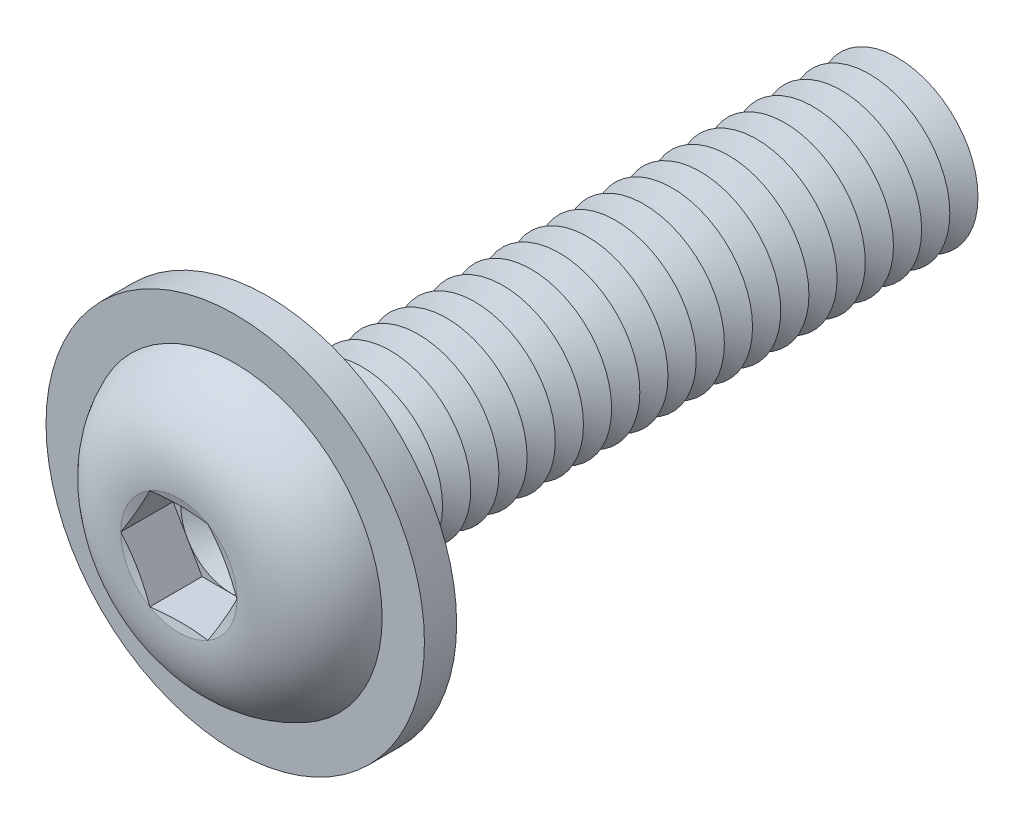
ISO-10303-21;
HEADER;
FILE_DESCRIPTION(('STEP AP214'),'2;1');
FILE_NAME('part.step','',(''),(''),'','','');
FILE_SCHEMA(('AUTOMOTIVE_DESIGN { 1 0 10303 214 1 1 1 1 }'));
ENDSEC;
DATA;
#1=APPLICATION_CONTEXT('core data for automotive mechanical design processes');
#2=APPLICATION_PROTOCOL_DEFINITION('international standard','automotive_design',2000,#1);
#3=PRODUCT_CONTEXT('',#1,'mechanical');
#4=PRODUCT('Part','Part','',(#3));
#5=PRODUCT_RELATED_PRODUCT_CATEGORY('part','',(#4));
#6=PRODUCT_DEFINITION_FORMATION('','',#4);
#7=PRODUCT_DEFINITION_CONTEXT('part definition',#1,'design');
#8=PRODUCT_DEFINITION('design','',#6,#7);
#9=PRODUCT_DEFINITION_SHAPE('','',#8);
#10=(LENGTH_UNIT() NAMED_UNIT(*) SI_UNIT(.MILLI.,.METRE.));
#11=(NAMED_UNIT(*) PLANE_ANGLE_UNIT() SI_UNIT($,.RADIAN.));
#12=(NAMED_UNIT(*) SI_UNIT($,.STERADIAN.) SOLID_ANGLE_UNIT());
#13=UNCERTAINTY_MEASURE_WITH_UNIT(LENGTH_MEASURE(1.E-05),#10,'distance_accuracy_value','');
#14=(GEOMETRIC_REPRESENTATION_CONTEXT(3) GLOBAL_UNCERTAINTY_ASSIGNED_CONTEXT((#13)) GLOBAL_UNIT_ASSIGNED_CONTEXT((#10,
#11,#12)) REPRESENTATION_CONTEXT('',''));
#15=CARTESIAN_POINT('',(0.,0.,0.));
#16=DIRECTION('',(0.,0.,1.));
#17=DIRECTION('',(1.,0.,0.));
#18=AXIS2_PLACEMENT_3D('',#15,#16,#17);
#19=CARTESIAN_POINT('',(0.,0.,-13.55));
#20=DIRECTION('',(0.,0.,1.));
#21=DIRECTION('',(1.,0.,0.));
#22=AXIS2_PLACEMENT_3D('',#19,#20,#21);
#23=CONICAL_SURFACE('',#22,2.,1.0471975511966);
#24=CARTESIAN_POINT('',(0.,0.,-13.9));
#25=DIRECTION('',(0.,0.,1.));
#26=DIRECTION('',(1.,0.,0.));
#27=AXIS2_PLACEMENT_3D('',#24,#25,#26);
#28=CIRCLE('',#27,1.3937822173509);
#29=CARTESIAN_POINT('',(1.3937822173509,0.,-13.9));
#30=VERTEX_POINT('',#29);
#31=EDGE_CURVE('E386',#30,#30,#28,.T.);
#32=ORIENTED_EDGE('',*,*,#31,.T.);
#33=EDGE_LOOP('',(#32));
#34=FACE_BOUND('',#33,.T.);
#35=CARTESIAN_POINT('',(0.,0.,-13.55));
#36=DIRECTION('',(0.,0.,1.));
#37=DIRECTION('',(1.,0.,0.));
#38=AXIS2_PLACEMENT_3D('',#35,#36,#37);
#39=CIRCLE('',#38,2.);
#40=CARTESIAN_POINT('',(2.,0.,-13.55));
#41=VERTEX_POINT('',#40);
#42=EDGE_CURVE('E382',#41,#41,#39,.T.);
#43=ORIENTED_EDGE('',*,*,#42,.F.);
#44=EDGE_LOOP('',(#43));
#45=FACE_BOUND('',#44,.T.);
#46=ADVANCED_FACE('F39',(#34,#45),#23,.T.);
#47=CARTESIAN_POINT('',(0.,0.,-13.9));
#48=DIRECTION('',(0.,0.,-1.));
#49=DIRECTION('',(-1.,0.,0.));
#50=AXIS2_PLACEMENT_3D('',#47,#48,#49);
#51=CONICAL_SURFACE('',#50,1.3937822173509,1.0471975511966);
#52=CARTESIAN_POINT('',(0.,0.,-14.25));
#53=DIRECTION('',(0.,0.,1.));
#54=DIRECTION('',(1.,0.,0.));
#55=AXIS2_PLACEMENT_3D('',#52,#53,#54);
#56=CIRCLE('',#55,2.);
#57=CARTESIAN_POINT('',(2.,0.,-14.25));
#58=VERTEX_POINT('',#57);
#59=EDGE_CURVE('E390',#58,#58,#56,.T.);
#60=ORIENTED_EDGE('',*,*,#59,.T.);
#61=EDGE_LOOP('',(#60));
#62=FACE_BOUND('',#61,.T.);
#63=ORIENTED_EDGE('',*,*,#31,.F.);
#64=EDGE_LOOP('',(#63));
#65=FACE_BOUND('',#64,.T.);
#66=ADVANCED_FACE('F509',(#62,#65),#51,.T.);
#67=CARTESIAN_POINT('',(0.,2.00000000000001,-16.));
#68=DIRECTION('',(0.,0.,-1.));
#69=DIRECTION('',(-1.,0.,0.));
#70=AXIS2_PLACEMENT_3D('',#67,#68,#69);
#71=PLANE('',#70);
#72=CARTESIAN_POINT('',(0.,0.,-16.));
#73=DIRECTION('',(0.,0.,1.));
#74=DIRECTION('',(1.,0.,0.));
#75=AXIS2_PLACEMENT_3D('',#72,#73,#74);
#76=CIRCLE('',#75,1.3937822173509);
#77=CARTESIAN_POINT('',(1.3937822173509,0.,-16.));
#78=VERTEX_POINT('',#77);
#79=EDGE_CURVE('E409',#78,#78,#76,.T.);
#80=ORIENTED_EDGE('',*,*,#79,.F.);
#81=EDGE_LOOP('',(#80));
#82=FACE_BOUND('',#81,.T.);
#83=ADVANCED_FACE('F515',(#82),#71,.T.);
#84=CARTESIAN_POINT('',(0.,0.,-15.65));
#85=DIRECTION('',(0.,0.,1.));
#86=DIRECTION('',(1.,0.,0.));
#87=AXIS2_PLACEMENT_3D('',#84,#85,#86);
#88=CONICAL_SURFACE('',#87,2.,1.0471975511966);
#89=ORIENTED_EDGE('',*,*,#79,.T.);
#90=EDGE_LOOP('',(#89));
#91=FACE_BOUND('',#90,.T.);
#92=CARTESIAN_POINT('',(0.,0.,-15.65));
#93=DIRECTION('',(0.,0.,1.));
#94=DIRECTION('',(1.,0.,0.));
#95=AXIS2_PLACEMENT_3D('',#92,#93,#94);
#96=CIRCLE('',#95,2.);
#97=CARTESIAN_POINT('',(2.,0.,-15.65));
#98=VERTEX_POINT('',#97);
#99=EDGE_CURVE('E405',#98,#98,#96,.T.);
#100=ORIENTED_EDGE('',*,*,#99,.F.);
#101=EDGE_LOOP('',(#100));
#102=FACE_BOUND('',#101,.T.);
#103=ADVANCED_FACE('F534',(#91,#102),#88,.T.);
#104=CARTESIAN_POINT('',(0.,0.,-15.3));
#105=DIRECTION('',(0.,0.,-1.));
#106=DIRECTION('',(-1.,0.,0.));
#107=AXIS2_PLACEMENT_3D('',#104,#105,#106);
#108=CONICAL_SURFACE('',#107,1.3937822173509,1.0471975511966);
#109=ORIENTED_EDGE('',*,*,#99,.T.);
#110=EDGE_LOOP('',(#109));
#111=FACE_BOUND('',#110,.T.);
#112=CARTESIAN_POINT('',(0.,0.,-15.3));
#113=DIRECTION('',(0.,0.,1.));
#114=DIRECTION('',(1.,0.,0.));
#115=AXIS2_PLACEMENT_3D('',#112,#113,#114);
#116=CIRCLE('',#115,1.3937822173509);
#117=CARTESIAN_POINT('',(1.3937822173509,0.,-15.3));
#118=VERTEX_POINT('',#117);
#119=EDGE_CURVE('E402',#118,#118,#116,.T.);
#120=ORIENTED_EDGE('',*,*,#119,.F.);
#121=EDGE_LOOP('',(#120));
#122=FACE_BOUND('',#121,.T.);
#123=ADVANCED_FACE('F531',(#111,#122),#108,.T.);
#124=CARTESIAN_POINT('',(0.,0.,-14.95));
#125=DIRECTION('',(0.,0.,1.));
#126=DIRECTION('',(1.,0.,0.));
#127=AXIS2_PLACEMENT_3D('',#124,#125,#126);
#128=CONICAL_SURFACE('',#127,2.,1.0471975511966);
#129=ORIENTED_EDGE('',*,*,#119,.T.);
#130=EDGE_LOOP('',(#129));
#131=FACE_BOUND('',#130,.T.);
#132=CARTESIAN_POINT('',(0.,0.,-14.95));
#133=DIRECTION('',(0.,0.,1.));
#134=DIRECTION('',(1.,0.,0.));
#135=AXIS2_PLACEMENT_3D('',#132,#133,#134);
#136=CIRCLE('',#135,2.);
#137=CARTESIAN_POINT('',(2.,0.,-14.95));
#138=VERTEX_POINT('',#137);
#139=EDGE_CURVE('E398',#138,#138,#136,.T.);
#140=ORIENTED_EDGE('',*,*,#139,.F.);
#141=EDGE_LOOP('',(#140));
#142=FACE_BOUND('',#141,.T.);
#143=ADVANCED_FACE('F525',(#131,#142),#128,.T.);
#144=CARTESIAN_POINT('',(0.,0.,-14.6));
#145=DIRECTION('',(0.,0.,-1.));
#146=DIRECTION('',(-1.,0.,0.));
#147=AXIS2_PLACEMENT_3D('',#144,#145,#146);
#148=CONICAL_SURFACE('',#147,1.3937822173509,1.0471975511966);
#149=ORIENTED_EDGE('',*,*,#139,.T.);
#150=EDGE_LOOP('',(#149));
#151=FACE_BOUND('',#150,.T.);
#152=CARTESIAN_POINT('',(0.,0.,-14.6));
#153=DIRECTION('',(0.,0.,1.));
#154=DIRECTION('',(1.,0.,0.));
#155=AXIS2_PLACEMENT_3D('',#152,#153,#154);
#156=CIRCLE('',#155,1.3937822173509);
#157=CARTESIAN_POINT('',(1.3937822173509,0.,-14.6));
#158=VERTEX_POINT('',#157);
#159=EDGE_CURVE('E394',#158,#158,#156,.T.);
#160=ORIENTED_EDGE('',*,*,#159,.F.);
#161=EDGE_LOOP('',(#160));
#162=FACE_BOUND('',#161,.T.);
#163=ADVANCED_FACE('F521',(#151,#162),#148,.T.);
#164=CARTESIAN_POINT('',(0.,0.,-14.25));
#165=DIRECTION('',(0.,0.,1.));
#166=DIRECTION('',(1.,0.,0.));
#167=AXIS2_PLACEMENT_3D('',#164,#165,#166);
#168=CONICAL_SURFACE('',#167,2.,1.0471975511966);
#169=ORIENTED_EDGE('',*,*,#159,.T.);
#170=EDGE_LOOP('',(#169));
#171=FACE_BOUND('',#170,.T.);
#172=ORIENTED_EDGE('',*,*,#59,.F.);
#173=EDGE_LOOP('',(#172));
#174=FACE_BOUND('',#173,.T.);
#175=ADVANCED_FACE('F524',(#171,#174),#168,.T.);
#176=CARTESIAN_POINT('',(0.,0.,-12.85));
#177=DIRECTION('',(0.,0.,1.));
#178=DIRECTION('',(1.,0.,0.));
#179=AXIS2_PLACEMENT_3D('',#176,#177,#178);
#180=CONICAL_SURFACE('',#179,2.,1.0471975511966);
#181=CARTESIAN_POINT('',(0.,0.,-13.2));
#182=DIRECTION('',(0.,0.,1.));
#183=DIRECTION('',(1.,0.,0.));
#184=AXIS2_PLACEMENT_3D('',#181,#182,#183);
#185=CIRCLE('',#184,1.3937822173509);
#186=CARTESIAN_POINT('',(1.3937822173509,0.,-13.2));
#187=VERTEX_POINT('',#186);
#188=EDGE_CURVE('E378',#187,#187,#185,.T.);
#189=ORIENTED_EDGE('',*,*,#188,.T.);
#190=EDGE_LOOP('',(#189));
#191=FACE_BOUND('',#190,.T.);
#192=CARTESIAN_POINT('',(0.,0.,-12.85));
#193=DIRECTION('',(0.,0.,1.));
#194=DIRECTION('',(1.,0.,0.));
#195=AXIS2_PLACEMENT_3D('',#192,#193,#194);
#196=CIRCLE('',#195,2.);
#197=CARTESIAN_POINT('',(2.,0.,-12.85));
#198=VERTEX_POINT('',#197);
#199=EDGE_CURVE('E374',#198,#198,#196,.T.);
#200=ORIENTED_EDGE('',*,*,#199,.F.);
#201=EDGE_LOOP('',(#200));
#202=FACE_BOUND('',#201,.T.);
#203=ADVANCED_FACE('F529',(#191,#202),#180,.T.);
#204=CARTESIAN_POINT('',(0.,0.,-13.2));
#205=DIRECTION('',(0.,0.,-1.));
#206=DIRECTION('',(-1.,0.,0.));
#207=AXIS2_PLACEMENT_3D('',#204,#205,#206);
#208=CONICAL_SURFACE('',#207,1.3937822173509,1.0471975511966);
#209=ORIENTED_EDGE('',*,*,#42,.T.);
#210=EDGE_LOOP('',(#209));
#211=FACE_BOUND('',#210,.T.);
#212=ORIENTED_EDGE('',*,*,#188,.F.);
#213=EDGE_LOOP('',(#212));
#214=FACE_BOUND('',#213,.T.);
#215=ADVANCED_FACE('F580',(#211,#214),#208,.T.);
#216=CARTESIAN_POINT('',(0.,0.,-12.15));
#217=DIRECTION('',(0.,0.,1.));
#218=DIRECTION('',(1.,0.,0.));
#219=AXIS2_PLACEMENT_3D('',#216,#217,#218);
#220=CONICAL_SURFACE('',#219,2.,1.0471975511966);
#221=CARTESIAN_POINT('',(0.,0.,-12.5));
#222=DIRECTION('',(0.,0.,1.));
#223=DIRECTION('',(1.,0.,0.));
#224=AXIS2_PLACEMENT_3D('',#221,#222,#223);
#225=CIRCLE('',#224,1.3937822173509);
#226=CARTESIAN_POINT('',(1.3937822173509,0.,-12.5));
#227=VERTEX_POINT('',#226);
#228=EDGE_CURVE('E370',#227,#227,#225,.T.);
#229=ORIENTED_EDGE('',*,*,#228,.T.);
#230=EDGE_LOOP('',(#229));
#231=FACE_BOUND('',#230,.T.);
#232=CARTESIAN_POINT('',(0.,0.,-12.15));
#233=DIRECTION('',(0.,0.,1.));
#234=DIRECTION('',(1.,0.,0.));
#235=AXIS2_PLACEMENT_3D('',#232,#233,#234);
#236=CIRCLE('',#235,2.);
#237=CARTESIAN_POINT('',(2.,0.,-12.15));
#238=VERTEX_POINT('',#237);
#239=EDGE_CURVE('E366',#238,#238,#236,.T.);
#240=ORIENTED_EDGE('',*,*,#239,.F.);
#241=EDGE_LOOP('',(#240));
#242=FACE_BOUND('',#241,.T.);
#243=ADVANCED_FACE('F586',(#231,#242),#220,.T.);
#244=CARTESIAN_POINT('',(0.,0.,-12.5));
#245=DIRECTION('',(0.,0.,-1.));
#246=DIRECTION('',(-1.,0.,0.));
#247=AXIS2_PLACEMENT_3D('',#244,#245,#246);
#248=CONICAL_SURFACE('',#247,1.3937822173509,1.0471975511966);
#249=ORIENTED_EDGE('',*,*,#199,.T.);
#250=EDGE_LOOP('',(#249));
#251=FACE_BOUND('',#250,.T.);
#252=ORIENTED_EDGE('',*,*,#228,.F.);
#253=EDGE_LOOP('',(#252));
#254=FACE_BOUND('',#253,.T.);
#255=ADVANCED_FACE('F593',(#251,#254),#248,.T.);
#256=CARTESIAN_POINT('',(0.,0.,-11.45));
#257=DIRECTION('',(0.,0.,1.));
#258=DIRECTION('',(1.,0.,0.));
#259=AXIS2_PLACEMENT_3D('',#256,#257,#258);
#260=CONICAL_SURFACE('',#259,2.,1.0471975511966);
#261=CARTESIAN_POINT('',(0.,0.,-11.8));
#262=DIRECTION('',(0.,0.,1.));
#263=DIRECTION('',(1.,0.,0.));
#264=AXIS2_PLACEMENT_3D('',#261,#262,#263);
#265=CIRCLE('',#264,1.3937822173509);
#266=CARTESIAN_POINT('',(1.3937822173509,0.,-11.8));
#267=VERTEX_POINT('',#266);
#268=EDGE_CURVE('E362',#267,#267,#265,.T.);
#269=ORIENTED_EDGE('',*,*,#268,.T.);
#270=EDGE_LOOP('',(#269));
#271=FACE_BOUND('',#270,.T.);
#272=CARTESIAN_POINT('',(0.,0.,-11.45));
#273=DIRECTION('',(0.,0.,1.));
#274=DIRECTION('',(1.,0.,0.));
#275=AXIS2_PLACEMENT_3D('',#272,#273,#274);
#276=CIRCLE('',#275,2.);
#277=CARTESIAN_POINT('',(2.,0.,-11.45));
#278=VERTEX_POINT('',#277);
#279=EDGE_CURVE('E358',#278,#278,#276,.T.);
#280=ORIENTED_EDGE('',*,*,#279,.F.);
#281=EDGE_LOOP('',(#280));
#282=FACE_BOUND('',#281,.T.);
#283=ADVANCED_FACE('F600',(#271,#282),#260,.T.);
#284=CARTESIAN_POINT('',(0.,0.,-11.8));
#285=DIRECTION('',(0.,0.,-1.));
#286=DIRECTION('',(-1.,0.,0.));
#287=AXIS2_PLACEMENT_3D('',#284,#285,#286);
#288=CONICAL_SURFACE('',#287,1.3937822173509,1.0471975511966);
#289=ORIENTED_EDGE('',*,*,#239,.T.);
#290=EDGE_LOOP('',(#289));
#291=FACE_BOUND('',#290,.T.);
#292=ORIENTED_EDGE('',*,*,#268,.F.);
#293=EDGE_LOOP('',(#292));
#294=FACE_BOUND('',#293,.T.);
#295=ADVANCED_FACE('F607',(#291,#294),#288,.T.);
#296=CARTESIAN_POINT('',(0.,0.,-10.75));
#297=DIRECTION('',(0.,0.,1.));
#298=DIRECTION('',(1.,0.,0.));
#299=AXIS2_PLACEMENT_3D('',#296,#297,#298);
#300=CONICAL_SURFACE('',#299,2.,1.0471975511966);
#301=CARTESIAN_POINT('',(0.,0.,-11.1));
#302=DIRECTION('',(0.,0.,1.));
#303=DIRECTION('',(1.,0.,0.));
#304=AXIS2_PLACEMENT_3D('',#301,#302,#303);
#305=CIRCLE('',#304,1.3937822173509);
#306=CARTESIAN_POINT('',(1.3937822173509,0.,-11.1));
#307=VERTEX_POINT('',#306);
#308=EDGE_CURVE('E354',#307,#307,#305,.T.);
#309=ORIENTED_EDGE('',*,*,#308,.T.);
#310=EDGE_LOOP('',(#309));
#311=FACE_BOUND('',#310,.T.);
#312=CARTESIAN_POINT('',(0.,0.,-10.75));
#313=DIRECTION('',(0.,0.,1.));
#314=DIRECTION('',(1.,0.,0.));
#315=AXIS2_PLACEMENT_3D('',#312,#313,#314);
#316=CIRCLE('',#315,2.);
#317=CARTESIAN_POINT('',(2.,0.,-10.75));
#318=VERTEX_POINT('',#317);
#319=EDGE_CURVE('E350',#318,#318,#316,.T.);
#320=ORIENTED_EDGE('',*,*,#319,.F.);
#321=EDGE_LOOP('',(#320));
#322=FACE_BOUND('',#321,.T.);
#323=ADVANCED_FACE('F614',(#311,#322),#300,.T.);
#324=CARTESIAN_POINT('',(0.,0.,-11.1));
#325=DIRECTION('',(0.,0.,-1.));
#326=DIRECTION('',(-1.,0.,0.));
#327=AXIS2_PLACEMENT_3D('',#324,#325,#326);
#328=CONICAL_SURFACE('',#327,1.3937822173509,1.0471975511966);
#329=ORIENTED_EDGE('',*,*,#279,.T.);
#330=EDGE_LOOP('',(#329));
#331=FACE_BOUND('',#330,.T.);
#332=ORIENTED_EDGE('',*,*,#308,.F.);
#333=EDGE_LOOP('',(#332));
#334=FACE_BOUND('',#333,.T.);
#335=ADVANCED_FACE('F621',(#331,#334),#328,.T.);
#336=CARTESIAN_POINT('',(0.,0.,-10.05));
#337=DIRECTION('',(0.,0.,1.));
#338=DIRECTION('',(1.,0.,0.));
#339=AXIS2_PLACEMENT_3D('',#336,#337,#338);
#340=CONICAL_SURFACE('',#339,2.,1.0471975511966);
#341=CARTESIAN_POINT('',(0.,0.,-10.4));
#342=DIRECTION('',(0.,0.,1.));
#343=DIRECTION('',(1.,0.,0.));
#344=AXIS2_PLACEMENT_3D('',#341,#342,#343);
#345=CIRCLE('',#344,1.3937822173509);
#346=CARTESIAN_POINT('',(1.3937822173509,0.,-10.4));
#347=VERTEX_POINT('',#346);
#348=EDGE_CURVE('E346',#347,#347,#345,.T.);
#349=ORIENTED_EDGE('',*,*,#348,.T.);
#350=EDGE_LOOP('',(#349));
#351=FACE_BOUND('',#350,.T.);
#352=CARTESIAN_POINT('',(0.,0.,-10.05));
#353=DIRECTION('',(0.,0.,1.));
#354=DIRECTION('',(1.,0.,0.));
#355=AXIS2_PLACEMENT_3D('',#352,#353,#354);
#356=CIRCLE('',#355,2.);
#357=CARTESIAN_POINT('',(2.,0.,-10.05));
#358=VERTEX_POINT('',#357);
#359=EDGE_CURVE('E342',#358,#358,#356,.T.);
#360=ORIENTED_EDGE('',*,*,#359,.F.);
#361=EDGE_LOOP('',(#360));
#362=FACE_BOUND('',#361,.T.);
#363=ADVANCED_FACE('F628',(#351,#362),#340,.T.);
#364=CARTESIAN_POINT('',(0.,0.,-10.4));
#365=DIRECTION('',(0.,0.,-1.));
#366=DIRECTION('',(-1.,0.,0.));
#367=AXIS2_PLACEMENT_3D('',#364,#365,#366);
#368=CONICAL_SURFACE('',#367,1.3937822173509,1.0471975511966);
#369=ORIENTED_EDGE('',*,*,#319,.T.);
#370=EDGE_LOOP('',(#369));
#371=FACE_BOUND('',#370,.T.);
#372=ORIENTED_EDGE('',*,*,#348,.F.);
#373=EDGE_LOOP('',(#372));
#374=FACE_BOUND('',#373,.T.);
#375=ADVANCED_FACE('F635',(#371,#374),#368,.T.);
#376=CARTESIAN_POINT('',(0.,0.,-9.35));
#377=DIRECTION('',(0.,0.,1.));
#378=DIRECTION('',(1.,0.,0.));
#379=AXIS2_PLACEMENT_3D('',#376,#377,#378);
#380=CONICAL_SURFACE('',#379,2.,1.0471975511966);
#381=CARTESIAN_POINT('',(0.,0.,-9.7));
#382=DIRECTION('',(0.,0.,1.));
#383=DIRECTION('',(1.,0.,0.));
#384=AXIS2_PLACEMENT_3D('',#381,#382,#383);
#385=CIRCLE('',#384,1.3937822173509);
#386=CARTESIAN_POINT('',(1.3937822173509,0.,-9.7));
#387=VERTEX_POINT('',#386);
#388=EDGE_CURVE('E338',#387,#387,#385,.T.);
#389=ORIENTED_EDGE('',*,*,#388,.T.);
#390=EDGE_LOOP('',(#389));
#391=FACE_BOUND('',#390,.T.);
#392=CARTESIAN_POINT('',(0.,0.,-9.35));
#393=DIRECTION('',(0.,0.,1.));
#394=DIRECTION('',(1.,0.,0.));
#395=AXIS2_PLACEMENT_3D('',#392,#393,#394);
#396=CIRCLE('',#395,2.);
#397=CARTESIAN_POINT('',(2.,0.,-9.35));
#398=VERTEX_POINT('',#397);
#399=EDGE_CURVE('E334',#398,#398,#396,.T.);
#400=ORIENTED_EDGE('',*,*,#399,.F.);
#401=EDGE_LOOP('',(#400));
#402=FACE_BOUND('',#401,.T.);
#403=ADVANCED_FACE('F642',(#391,#402),#380,.T.);
#404=CARTESIAN_POINT('',(0.,0.,-9.7));
#405=DIRECTION('',(0.,0.,-1.));
#406=DIRECTION('',(-1.,0.,0.));
#407=AXIS2_PLACEMENT_3D('',#404,#405,#406);
#408=CONICAL_SURFACE('',#407,1.3937822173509,1.0471975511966);
#409=ORIENTED_EDGE('',*,*,#359,.T.);
#410=EDGE_LOOP('',(#409));
#411=FACE_BOUND('',#410,.T.);
#412=ORIENTED_EDGE('',*,*,#388,.F.);
#413=EDGE_LOOP('',(#412));
#414=FACE_BOUND('',#413,.T.);
#415=ADVANCED_FACE('F649',(#411,#414),#408,.T.);
#416=CARTESIAN_POINT('',(0.,0.,-8.65));
#417=DIRECTION('',(0.,0.,1.));
#418=DIRECTION('',(1.,0.,0.));
#419=AXIS2_PLACEMENT_3D('',#416,#417,#418);
#420=CONICAL_SURFACE('',#419,2.,1.0471975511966);
#421=CARTESIAN_POINT('',(0.,0.,-9.));
#422=DIRECTION('',(0.,0.,1.));
#423=DIRECTION('',(1.,0.,0.));
#424=AXIS2_PLACEMENT_3D('',#421,#422,#423);
#425=CIRCLE('',#424,1.3937822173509);
#426=CARTESIAN_POINT('',(1.3937822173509,0.,-9.));
#427=VERTEX_POINT('',#426);
#428=EDGE_CURVE('E330',#427,#427,#425,.T.);
#429=ORIENTED_EDGE('',*,*,#428,.T.);
#430=EDGE_LOOP('',(#429));
#431=FACE_BOUND('',#430,.T.);
#432=CARTESIAN_POINT('',(0.,0.,-8.65));
#433=DIRECTION('',(0.,0.,1.));
#434=DIRECTION('',(1.,0.,0.));
#435=AXIS2_PLACEMENT_3D('',#432,#433,#434);
#436=CIRCLE('',#435,2.);
#437=CARTESIAN_POINT('',(2.,0.,-8.65));
#438=VERTEX_POINT('',#437);
#439=EDGE_CURVE('E326',#438,#438,#436,.T.);
#440=ORIENTED_EDGE('',*,*,#439,.F.);
#441=EDGE_LOOP('',(#440));
#442=FACE_BOUND('',#441,.T.);
#443=ADVANCED_FACE('F656',(#431,#442),#420,.T.);
#444=CARTESIAN_POINT('',(0.,0.,-9.));
#445=DIRECTION('',(0.,0.,-1.));
#446=DIRECTION('',(-1.,0.,0.));
#447=AXIS2_PLACEMENT_3D('',#444,#445,#446);
#448=CONICAL_SURFACE('',#447,1.3937822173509,1.0471975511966);
#449=ORIENTED_EDGE('',*,*,#399,.T.);
#450=EDGE_LOOP('',(#449));
#451=FACE_BOUND('',#450,.T.);
#452=ORIENTED_EDGE('',*,*,#428,.F.);
#453=EDGE_LOOP('',(#452));
#454=FACE_BOUND('',#453,.T.);
#455=ADVANCED_FACE('F663',(#451,#454),#448,.T.);
#456=CARTESIAN_POINT('',(0.,0.,-7.95));
#457=DIRECTION('',(0.,0.,1.));
#458=DIRECTION('',(1.,0.,0.));
#459=AXIS2_PLACEMENT_3D('',#456,#457,#458);
#460=CONICAL_SURFACE('',#459,2.,1.0471975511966);
#461=CARTESIAN_POINT('',(0.,0.,-8.3));
#462=DIRECTION('',(0.,0.,1.));
#463=DIRECTION('',(1.,0.,0.));
#464=AXIS2_PLACEMENT_3D('',#461,#462,#463);
#465=CIRCLE('',#464,1.3937822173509);
#466=CARTESIAN_POINT('',(1.3937822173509,0.,-8.3));
#467=VERTEX_POINT('',#466);
#468=EDGE_CURVE('E322',#467,#467,#465,.T.);
#469=ORIENTED_EDGE('',*,*,#468,.T.);
#470=EDGE_LOOP('',(#469));
#471=FACE_BOUND('',#470,.T.);
#472=CARTESIAN_POINT('',(0.,0.,-7.95));
#473=DIRECTION('',(0.,0.,1.));
#474=DIRECTION('',(1.,0.,0.));
#475=AXIS2_PLACEMENT_3D('',#472,#473,#474);
#476=CIRCLE('',#475,2.);
#477=CARTESIAN_POINT('',(2.,0.,-7.95));
#478=VERTEX_POINT('',#477);
#479=EDGE_CURVE('E318',#478,#478,#476,.T.);
#480=ORIENTED_EDGE('',*,*,#479,.F.);
#481=EDGE_LOOP('',(#480));
#482=FACE_BOUND('',#481,.T.);
#483=ADVANCED_FACE('F670',(#471,#482),#460,.T.);
#484=CARTESIAN_POINT('',(0.,0.,-8.3));
#485=DIRECTION('',(0.,0.,-1.));
#486=DIRECTION('',(-1.,0.,0.));
#487=AXIS2_PLACEMENT_3D('',#484,#485,#486);
#488=CONICAL_SURFACE('',#487,1.3937822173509,1.0471975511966);
#489=ORIENTED_EDGE('',*,*,#439,.T.);
#490=EDGE_LOOP('',(#489));
#491=FACE_BOUND('',#490,.T.);
#492=ORIENTED_EDGE('',*,*,#468,.F.);
#493=EDGE_LOOP('',(#492));
#494=FACE_BOUND('',#493,.T.);
#495=ADVANCED_FACE('F677',(#491,#494),#488,.T.);
#496=CARTESIAN_POINT('',(0.,0.,-7.25));
#497=DIRECTION('',(0.,0.,1.));
#498=DIRECTION('',(1.,0.,0.));
#499=AXIS2_PLACEMENT_3D('',#496,#497,#498);
#500=CONICAL_SURFACE('',#499,2.,1.0471975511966);
#501=CARTESIAN_POINT('',(0.,0.,-7.6));
#502=DIRECTION('',(0.,0.,1.));
#503=DIRECTION('',(1.,0.,0.));
#504=AXIS2_PLACEMENT_3D('',#501,#502,#503);
#505=CIRCLE('',#504,1.3937822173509);
#506=CARTESIAN_POINT('',(1.3937822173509,0.,-7.6));
#507=VERTEX_POINT('',#506);
#508=EDGE_CURVE('E314',#507,#507,#505,.T.);
#509=ORIENTED_EDGE('',*,*,#508,.T.);
#510=EDGE_LOOP('',(#509));
#511=FACE_BOUND('',#510,.T.);
#512=CARTESIAN_POINT('',(0.,0.,-7.25));
#513=DIRECTION('',(0.,0.,1.));
#514=DIRECTION('',(1.,0.,0.));
#515=AXIS2_PLACEMENT_3D('',#512,#513,#514);
#516=CIRCLE('',#515,2.);
#517=CARTESIAN_POINT('',(2.,0.,-7.25));
#518=VERTEX_POINT('',#517);
#519=EDGE_CURVE('E310',#518,#518,#516,.T.);
#520=ORIENTED_EDGE('',*,*,#519,.F.);
#521=EDGE_LOOP('',(#520));
#522=FACE_BOUND('',#521,.T.);
#523=ADVANCED_FACE('F684',(#511,#522),#500,.T.);
#524=CARTESIAN_POINT('',(0.,0.,-7.6));
#525=DIRECTION('',(0.,0.,-1.));
#526=DIRECTION('',(-1.,0.,0.));
#527=AXIS2_PLACEMENT_3D('',#524,#525,#526);
#528=CONICAL_SURFACE('',#527,1.3937822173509,1.0471975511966);
#529=ORIENTED_EDGE('',*,*,#479,.T.);
#530=EDGE_LOOP('',(#529));
#531=FACE_BOUND('',#530,.T.);
#532=ORIENTED_EDGE('',*,*,#508,.F.);
#533=EDGE_LOOP('',(#532));
#534=FACE_BOUND('',#533,.T.);
#535=ADVANCED_FACE('F691',(#531,#534),#528,.T.);
#536=CARTESIAN_POINT('',(0.,0.,-6.55));
#537=DIRECTION('',(0.,0.,1.));
#538=DIRECTION('',(1.,0.,0.));
#539=AXIS2_PLACEMENT_3D('',#536,#537,#538);
#540=CONICAL_SURFACE('',#539,2.,1.0471975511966);
#541=CARTESIAN_POINT('',(0.,0.,-6.9));
#542=DIRECTION('',(0.,0.,1.));
#543=DIRECTION('',(1.,0.,0.));
#544=AXIS2_PLACEMENT_3D('',#541,#542,#543);
#545=CIRCLE('',#544,1.3937822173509);
#546=CARTESIAN_POINT('',(1.3937822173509,0.,-6.9));
#547=VERTEX_POINT('',#546);
#548=EDGE_CURVE('E306',#547,#547,#545,.T.);
#549=ORIENTED_EDGE('',*,*,#548,.T.);
#550=EDGE_LOOP('',(#549));
#551=FACE_BOUND('',#550,.T.);
#552=CARTESIAN_POINT('',(0.,0.,-6.55));
#553=DIRECTION('',(0.,0.,1.));
#554=DIRECTION('',(1.,0.,0.));
#555=AXIS2_PLACEMENT_3D('',#552,#553,#554);
#556=CIRCLE('',#555,2.);
#557=CARTESIAN_POINT('',(2.,0.,-6.55));
#558=VERTEX_POINT('',#557);
#559=EDGE_CURVE('E302',#558,#558,#556,.T.);
#560=ORIENTED_EDGE('',*,*,#559,.F.);
#561=EDGE_LOOP('',(#560));
#562=FACE_BOUND('',#561,.T.);
#563=ADVANCED_FACE('F698',(#551,#562),#540,.T.);
#564=CARTESIAN_POINT('',(0.,0.,-6.9));
#565=DIRECTION('',(0.,0.,-1.));
#566=DIRECTION('',(-1.,0.,0.));
#567=AXIS2_PLACEMENT_3D('',#564,#565,#566);
#568=CONICAL_SURFACE('',#567,1.3937822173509,1.0471975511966);
#569=ORIENTED_EDGE('',*,*,#519,.T.);
#570=EDGE_LOOP('',(#569));
#571=FACE_BOUND('',#570,.T.);
#572=ORIENTED_EDGE('',*,*,#548,.F.);
#573=EDGE_LOOP('',(#572));
#574=FACE_BOUND('',#573,.T.);
#575=ADVANCED_FACE('F705',(#571,#574),#568,.T.);
#576=CARTESIAN_POINT('',(0.,0.,-5.85));
#577=DIRECTION('',(0.,0.,1.));
#578=DIRECTION('',(1.,0.,0.));
#579=AXIS2_PLACEMENT_3D('',#576,#577,#578);
#580=CONICAL_SURFACE('',#579,2.,1.0471975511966);
#581=CARTESIAN_POINT('',(0.,0.,-6.2));
#582=DIRECTION('',(0.,0.,1.));
#583=DIRECTION('',(1.,0.,0.));
#584=AXIS2_PLACEMENT_3D('',#581,#582,#583);
#585=CIRCLE('',#584,1.3937822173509);
#586=CARTESIAN_POINT('',(1.3937822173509,0.,-6.2));
#587=VERTEX_POINT('',#586);
#588=EDGE_CURVE('E298',#587,#587,#585,.T.);
#589=ORIENTED_EDGE('',*,*,#588,.T.);
#590=EDGE_LOOP('',(#589));
#591=FACE_BOUND('',#590,.T.);
#592=CARTESIAN_POINT('',(0.,0.,-5.85));
#593=DIRECTION('',(0.,0.,1.));
#594=DIRECTION('',(1.,0.,0.));
#595=AXIS2_PLACEMENT_3D('',#592,#593,#594);
#596=CIRCLE('',#595,2.);
#597=CARTESIAN_POINT('',(2.,0.,-5.85));
#598=VERTEX_POINT('',#597);
#599=EDGE_CURVE('E294',#598,#598,#596,.T.);
#600=ORIENTED_EDGE('',*,*,#599,.F.);
#601=EDGE_LOOP('',(#600));
#602=FACE_BOUND('',#601,.T.);
#603=ADVANCED_FACE('F712',(#591,#602),#580,.T.);
#604=CARTESIAN_POINT('',(0.,0.,-6.2));
#605=DIRECTION('',(0.,0.,-1.));
#606=DIRECTION('',(-1.,0.,0.));
#607=AXIS2_PLACEMENT_3D('',#604,#605,#606);
#608=CONICAL_SURFACE('',#607,1.3937822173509,1.0471975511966);
#609=ORIENTED_EDGE('',*,*,#559,.T.);
#610=EDGE_LOOP('',(#609));
#611=FACE_BOUND('',#610,.T.);
#612=ORIENTED_EDGE('',*,*,#588,.F.);
#613=EDGE_LOOP('',(#612));
#614=FACE_BOUND('',#613,.T.);
#615=ADVANCED_FACE('F719',(#611,#614),#608,.T.);
#616=CARTESIAN_POINT('',(0.,0.,-5.15));
#617=DIRECTION('',(0.,0.,1.));
#618=DIRECTION('',(1.,0.,0.));
#619=AXIS2_PLACEMENT_3D('',#616,#617,#618);
#620=CONICAL_SURFACE('',#619,2.,1.0471975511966);
#621=CARTESIAN_POINT('',(0.,0.,-5.5));
#622=DIRECTION('',(0.,0.,1.));
#623=DIRECTION('',(1.,0.,0.));
#624=AXIS2_PLACEMENT_3D('',#621,#622,#623);
#625=CIRCLE('',#624,1.3937822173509);
#626=CARTESIAN_POINT('',(1.3937822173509,0.,-5.5));
#627=VERTEX_POINT('',#626);
#628=EDGE_CURVE('E291',#627,#627,#625,.T.);
#629=ORIENTED_EDGE('',*,*,#628,.T.);
#630=EDGE_LOOP('',(#629));
#631=FACE_BOUND('',#630,.T.);
#632=CARTESIAN_POINT('',(0.,0.,-5.15));
#633=DIRECTION('',(0.,0.,1.));
#634=DIRECTION('',(1.,0.,0.));
#635=AXIS2_PLACEMENT_3D('',#632,#633,#634);
#636=CIRCLE('',#635,2.);
#637=CARTESIAN_POINT('',(2.,0.,-5.15));
#638=VERTEX_POINT('',#637);
#639=EDGE_CURVE('E287',#638,#638,#636,.T.);
#640=ORIENTED_EDGE('',*,*,#639,.F.);
#641=EDGE_LOOP('',(#640));
#642=FACE_BOUND('',#641,.T.);
#643=ADVANCED_FACE('F726',(#631,#642),#620,.T.);
#644=CARTESIAN_POINT('',(0.,0.,-5.5));
#645=DIRECTION('',(0.,0.,-1.));
#646=DIRECTION('',(-1.,0.,0.));
#647=AXIS2_PLACEMENT_3D('',#644,#645,#646);
#648=CONICAL_SURFACE('',#647,1.3937822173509,1.0471975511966);
#649=ORIENTED_EDGE('',*,*,#599,.T.);
#650=EDGE_LOOP('',(#649));
#651=FACE_BOUND('',#650,.T.);
#652=ORIENTED_EDGE('',*,*,#628,.F.);
#653=EDGE_LOOP('',(#652));
#654=FACE_BOUND('',#653,.T.);
#655=ADVANCED_FACE('F733',(#651,#654),#648,.T.);
#656=CARTESIAN_POINT('',(0.,0.,-4.45));
#657=DIRECTION('',(0.,0.,1.));
#658=DIRECTION('',(1.,0.,0.));
#659=AXIS2_PLACEMENT_3D('',#656,#657,#658);
#660=CONICAL_SURFACE('',#659,2.,1.0471975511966);
#661=CARTESIAN_POINT('',(0.,0.,-4.8));
#662=DIRECTION('',(0.,0.,1.));
#663=DIRECTION('',(1.,0.,0.));
#664=AXIS2_PLACEMENT_3D('',#661,#662,#663);
#665=CIRCLE('',#664,1.3937822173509);
#666=CARTESIAN_POINT('',(1.3937822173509,0.,-4.8));
#667=VERTEX_POINT('',#666);
#668=EDGE_CURVE('E283',#667,#667,#665,.T.);
#669=ORIENTED_EDGE('',*,*,#668,.T.);
#670=EDGE_LOOP('',(#669));
#671=FACE_BOUND('',#670,.T.);
#672=CARTESIAN_POINT('',(0.,0.,-4.45));
#673=DIRECTION('',(0.,0.,1.));
#674=DIRECTION('',(1.,0.,0.));
#675=AXIS2_PLACEMENT_3D('',#672,#673,#674);
#676=CIRCLE('',#675,2.);
#677=CARTESIAN_POINT('',(2.,0.,-4.45));
#678=VERTEX_POINT('',#677);
#679=EDGE_CURVE('E279',#678,#678,#676,.T.);
#680=ORIENTED_EDGE('',*,*,#679,.F.);
#681=EDGE_LOOP('',(#680));
#682=FACE_BOUND('',#681,.T.);
#683=ADVANCED_FACE('F740',(#671,#682),#660,.T.);
#684=CARTESIAN_POINT('',(0.,0.,-4.8));
#685=DIRECTION('',(0.,0.,-1.));
#686=DIRECTION('',(-1.,0.,0.));
#687=AXIS2_PLACEMENT_3D('',#684,#685,#686);
#688=CONICAL_SURFACE('',#687,1.3937822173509,1.0471975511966);
#689=ORIENTED_EDGE('',*,*,#639,.T.);
#690=EDGE_LOOP('',(#689));
#691=FACE_BOUND('',#690,.T.);
#692=ORIENTED_EDGE('',*,*,#668,.F.);
#693=EDGE_LOOP('',(#692));
#694=FACE_BOUND('',#693,.T.);
#695=ADVANCED_FACE('F747',(#691,#694),#688,.T.);
#696=CARTESIAN_POINT('',(0.,0.,-3.75));
#697=DIRECTION('',(0.,0.,1.));
#698=DIRECTION('',(1.,0.,0.));
#699=AXIS2_PLACEMENT_3D('',#696,#697,#698);
#700=CONICAL_SURFACE('',#699,2.,1.0471975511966);
#701=CARTESIAN_POINT('',(0.,0.,-4.1));
#702=DIRECTION('',(0.,0.,1.));
#703=DIRECTION('',(1.,0.,0.));
#704=AXIS2_PLACEMENT_3D('',#701,#702,#703);
#705=CIRCLE('',#704,1.3937822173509);
#706=CARTESIAN_POINT('',(1.3937822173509,0.,-4.1));
#707=VERTEX_POINT('',#706);
#708=EDGE_CURVE('E275',#707,#707,#705,.T.);
#709=ORIENTED_EDGE('',*,*,#708,.T.);
#710=EDGE_LOOP('',(#709));
#711=FACE_BOUND('',#710,.T.);
#712=CARTESIAN_POINT('',(0.,0.,-3.75));
#713=DIRECTION('',(0.,0.,1.));
#714=DIRECTION('',(1.,0.,0.));
#715=AXIS2_PLACEMENT_3D('',#712,#713,#714);
#716=CIRCLE('',#715,2.);
#717=CARTESIAN_POINT('',(2.,0.,-3.75));
#718=VERTEX_POINT('',#717);
#719=EDGE_CURVE('E271',#718,#718,#716,.T.);
#720=ORIENTED_EDGE('',*,*,#719,.F.);
#721=EDGE_LOOP('',(#720));
#722=FACE_BOUND('',#721,.T.);
#723=ADVANCED_FACE('F754',(#711,#722),#700,.T.);
#724=CARTESIAN_POINT('',(0.,0.,-4.1));
#725=DIRECTION('',(0.,0.,-1.));
#726=DIRECTION('',(-1.,0.,0.));
#727=AXIS2_PLACEMENT_3D('',#724,#725,#726);
#728=CONICAL_SURFACE('',#727,1.3937822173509,1.0471975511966);
#729=ORIENTED_EDGE('',*,*,#679,.T.);
#730=EDGE_LOOP('',(#729));
#731=FACE_BOUND('',#730,.T.);
#732=ORIENTED_EDGE('',*,*,#708,.F.);
#733=EDGE_LOOP('',(#732));
#734=FACE_BOUND('',#733,.T.);
#735=ADVANCED_FACE('F761',(#731,#734),#728,.T.);
#736=CARTESIAN_POINT('',(0.,0.,-3.05));
#737=DIRECTION('',(0.,0.,1.));
#738=DIRECTION('',(1.,0.,0.));
#739=AXIS2_PLACEMENT_3D('',#736,#737,#738);
#740=CONICAL_SURFACE('',#739,2.,1.0471975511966);
#741=CARTESIAN_POINT('',(0.,0.,-3.4));
#742=DIRECTION('',(0.,0.,1.));
#743=DIRECTION('',(1.,0.,0.));
#744=AXIS2_PLACEMENT_3D('',#741,#742,#743);
#745=CIRCLE('',#744,1.3937822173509);
#746=CARTESIAN_POINT('',(1.3937822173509,0.,-3.4));
#747=VERTEX_POINT('',#746);
#748=EDGE_CURVE('E267',#747,#747,#745,.T.);
#749=ORIENTED_EDGE('',*,*,#748,.T.);
#750=EDGE_LOOP('',(#749));
#751=FACE_BOUND('',#750,.T.);
#752=CARTESIAN_POINT('',(0.,0.,-3.05));
#753=DIRECTION('',(0.,0.,1.));
#754=DIRECTION('',(1.,0.,0.));
#755=AXIS2_PLACEMENT_3D('',#752,#753,#754);
#756=CIRCLE('',#755,2.);
#757=CARTESIAN_POINT('',(2.,0.,-3.05));
#758=VERTEX_POINT('',#757);
#759=EDGE_CURVE('E263',#758,#758,#756,.T.);
#760=ORIENTED_EDGE('',*,*,#759,.F.);
#761=EDGE_LOOP('',(#760));
#762=FACE_BOUND('',#761,.T.);
#763=ADVANCED_FACE('F768',(#751,#762),#740,.T.);
#764=CARTESIAN_POINT('',(0.,0.,-3.4));
#765=DIRECTION('',(0.,0.,-1.));
#766=DIRECTION('',(-1.,0.,0.));
#767=AXIS2_PLACEMENT_3D('',#764,#765,#766);
#768=CONICAL_SURFACE('',#767,1.3937822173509,1.0471975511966);
#769=ORIENTED_EDGE('',*,*,#719,.T.);
#770=EDGE_LOOP('',(#769));
#771=FACE_BOUND('',#770,.T.);
#772=ORIENTED_EDGE('',*,*,#748,.F.);
#773=EDGE_LOOP('',(#772));
#774=FACE_BOUND('',#773,.T.);
#775=ADVANCED_FACE('F775',(#771,#774),#768,.T.);
#776=CARTESIAN_POINT('',(0.,0.,-2.35));
#777=DIRECTION('',(0.,0.,1.));
#778=DIRECTION('',(1.,0.,0.));
#779=AXIS2_PLACEMENT_3D('',#776,#777,#778);
#780=CONICAL_SURFACE('',#779,2.,1.0471975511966);
#781=CARTESIAN_POINT('',(0.,0.,-2.7));
#782=DIRECTION('',(0.,0.,1.));
#783=DIRECTION('',(1.,0.,0.));
#784=AXIS2_PLACEMENT_3D('',#781,#782,#783);
#785=CIRCLE('',#784,1.3937822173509);
#786=CARTESIAN_POINT('',(1.3937822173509,0.,-2.7));
#787=VERTEX_POINT('',#786);
#788=EDGE_CURVE('E259',#787,#787,#785,.T.);
#789=ORIENTED_EDGE('',*,*,#788,.T.);
#790=EDGE_LOOP('',(#789));
#791=FACE_BOUND('',#790,.T.);
#792=CARTESIAN_POINT('',(0.,0.,-2.35));
#793=DIRECTION('',(0.,0.,1.));
#794=DIRECTION('',(1.,0.,0.));
#795=AXIS2_PLACEMENT_3D('',#792,#793,#794);
#796=CIRCLE('',#795,2.);
#797=CARTESIAN_POINT('',(2.,0.,-2.35));
#798=VERTEX_POINT('',#797);
#799=EDGE_CURVE('E255',#798,#798,#796,.T.);
#800=ORIENTED_EDGE('',*,*,#799,.F.);
#801=EDGE_LOOP('',(#800));
#802=FACE_BOUND('',#801,.T.);
#803=ADVANCED_FACE('F782',(#791,#802),#780,.T.);
#804=CARTESIAN_POINT('',(0.,0.,-2.7));
#805=DIRECTION('',(0.,0.,-1.));
#806=DIRECTION('',(-1.,0.,0.));
#807=AXIS2_PLACEMENT_3D('',#804,#805,#806);
#808=CONICAL_SURFACE('',#807,1.3937822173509,1.0471975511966);
#809=ORIENTED_EDGE('',*,*,#759,.T.);
#810=EDGE_LOOP('',(#809));
#811=FACE_BOUND('',#810,.T.);
#812=ORIENTED_EDGE('',*,*,#788,.F.);
#813=EDGE_LOOP('',(#812));
#814=FACE_BOUND('',#813,.T.);
#815=ADVANCED_FACE('F789',(#811,#814),#808,.T.);
#816=CARTESIAN_POINT('',(0.,0.,-1.65));
#817=DIRECTION('',(0.,0.,1.));
#818=DIRECTION('',(1.,0.,0.));
#819=AXIS2_PLACEMENT_3D('',#816,#817,#818);
#820=CONICAL_SURFACE('',#819,2.,1.0471975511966);
#821=CARTESIAN_POINT('',(0.,0.,-2.));
#822=DIRECTION('',(0.,0.,1.));
#823=DIRECTION('',(1.,0.,0.));
#824=AXIS2_PLACEMENT_3D('',#821,#822,#823);
#825=CIRCLE('',#824,1.3937822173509);
#826=CARTESIAN_POINT('',(1.3937822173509,0.,-2.));
#827=VERTEX_POINT('',#826);
#828=EDGE_CURVE('E251',#827,#827,#825,.T.);
#829=ORIENTED_EDGE('',*,*,#828,.T.);
#830=EDGE_LOOP('',(#829));
#831=FACE_BOUND('',#830,.T.);
#832=CARTESIAN_POINT('',(0.,0.,-1.65));
#833=DIRECTION('',(0.,0.,1.));
#834=DIRECTION('',(1.,0.,0.));
#835=AXIS2_PLACEMENT_3D('',#832,#833,#834);
#836=CIRCLE('',#835,2.);
#837=CARTESIAN_POINT('',(2.,0.,-1.65));
#838=VERTEX_POINT('',#837);
#839=EDGE_CURVE('E243',#838,#838,#836,.T.);
#840=ORIENTED_EDGE('',*,*,#839,.F.);
#841=EDGE_LOOP('',(#840));
#842=FACE_BOUND('',#841,.T.);
#843=ADVANCED_FACE('F796',(#831,#842),#820,.T.);
#844=CARTESIAN_POINT('',(0.,0.,-2.));
#845=DIRECTION('',(0.,0.,-1.));
#846=DIRECTION('',(-1.,0.,0.));
#847=AXIS2_PLACEMENT_3D('',#844,#845,#846);
#848=CONICAL_SURFACE('',#847,1.3937822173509,1.0471975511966);
#849=ORIENTED_EDGE('',*,*,#799,.T.);
#850=EDGE_LOOP('',(#849));
#851=FACE_BOUND('',#850,.T.);
#852=ORIENTED_EDGE('',*,*,#828,.F.);
#853=EDGE_LOOP('',(#852));
#854=FACE_BOUND('',#853,.T.);
#855=ADVANCED_FACE('F803',(#851,#854),#848,.T.);
#856=CARTESIAN_POINT('',(0.,0.,-0.950000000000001));
#857=DIRECTION('',(0.,0.,1.));
#858=DIRECTION('',(1.,0.,0.));
#859=AXIS2_PLACEMENT_3D('',#856,#857,#858);
#860=CONICAL_SURFACE('',#859,2.,1.0471975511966);
#861=CARTESIAN_POINT('',(0.,0.,-1.3));
#862=DIRECTION('',(0.,0.,1.));
#863=DIRECTION('',(1.,0.,0.));
#864=AXIS2_PLACEMENT_3D('',#861,#862,#863);
#865=CIRCLE('',#864,1.3937822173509);
#866=CARTESIAN_POINT('',(1.3937822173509,0.,-1.3));
#867=VERTEX_POINT('',#866);
#868=EDGE_CURVE('E232',#867,#867,#865,.T.);
#869=ORIENTED_EDGE('',*,*,#868,.T.);
#870=EDGE_LOOP('',(#869));
#871=FACE_BOUND('',#870,.T.);
#872=CARTESIAN_POINT('',(0.,0.,-0.950000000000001));
#873=DIRECTION('',(0.,0.,1.));
#874=DIRECTION('',(1.,0.,0.));
#875=AXIS2_PLACEMENT_3D('',#872,#873,#874);
#876=CIRCLE('',#875,2.);
#877=CARTESIAN_POINT('',(2.,0.,-0.950000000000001));
#878=VERTEX_POINT('',#877);
#879=EDGE_CURVE('E247',#878,#878,#876,.T.);
#880=ORIENTED_EDGE('',*,*,#879,.F.);
#881=EDGE_LOOP('',(#880));
#882=FACE_BOUND('',#881,.T.);
#883=ADVANCED_FACE('F810',(#871,#882),#860,.T.);
#884=CARTESIAN_POINT('',(0.,0.,-1.3));
#885=DIRECTION('',(0.,0.,-1.));
#886=DIRECTION('',(-1.,0.,0.));
#887=AXIS2_PLACEMENT_3D('',#884,#885,#886);
#888=CONICAL_SURFACE('',#887,1.3937822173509,1.0471975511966);
#889=ORIENTED_EDGE('',*,*,#839,.T.);
#890=EDGE_LOOP('',(#889));
#891=FACE_BOUND('',#890,.T.);
#892=ORIENTED_EDGE('',*,*,#868,.F.);
#893=EDGE_LOOP('',(#892));
#894=FACE_BOUND('',#893,.T.);
#895=ADVANCED_FACE('F221',(#891,#894),#888,.T.);
#896=CARTESIAN_POINT('',(0.,2.,0.));
#897=DIRECTION('',(0.,0.,-1.));
#898=DIRECTION('',(-1.,0.,0.));
#899=AXIS2_PLACEMENT_3D('',#896,#897,#898);
#900=PLANE('',#899);
#901=CARTESIAN_POINT('',(0.,0.,0.));
#902=DIRECTION('',(0.,0.,-1.));
#903=DIRECTION('',(-1.,0.,0.));
#904=AXIS2_PLACEMENT_3D('',#901,#902,#903);
#905=CIRCLE('',#904,2.35);
#906=CARTESIAN_POINT('',(-2.35,0.,0.));
#907=VERTEX_POINT('',#906);
#908=EDGE_CURVE('E423',#907,#907,#905,.F.);
#909=ORIENTED_EDGE('',*,*,#908,.T.);
#910=EDGE_LOOP('',(#909));
#911=FACE_BOUND('',#910,.T.);
#912=CARTESIAN_POINT('',(0.,0.,0.));
#913=DIRECTION('',(0.,0.,-1.));
#914=DIRECTION('',(0.,1.,0.));
#915=AXIS2_PLACEMENT_3D('',#912,#913,#914);
#916=CIRCLE('',#915,4.7);
#917=CARTESIAN_POINT('',(0.,4.7,0.));
#918=VERTEX_POINT('',#917);
#919=EDGE_CURVE('E1225',#918,#918,#916,.T.);
#920=ORIENTED_EDGE('',*,*,#919,.T.);
#921=EDGE_LOOP('',(#920));
#922=FACE_BOUND('',#921,.T.);
#923=ADVANCED_FACE('F822',(#911,#922),#900,.T.);
#924=CARTESIAN_POINT('',(0.,0.,-0.35));
#925=DIRECTION('',(0.,0.,-1.));
#926=DIRECTION('',(-1.,0.,0.));
#927=AXIS2_PLACEMENT_3D('',#924,#925,#926);
#928=TOROIDAL_SURFACE('',#927,2.35,0.35);
#929=ORIENTED_EDGE('',*,*,#908,.F.);
#930=EDGE_LOOP('',(#929));
#931=FACE_BOUND('',#930,.T.);
#932=CARTESIAN_POINT('',(0.,0.,-0.35));
#933=DIRECTION('',(0.,0.,-1.));
#934=DIRECTION('',(-1.,0.,0.));
#935=AXIS2_PLACEMENT_3D('',#932,#933,#934);
#936=CIRCLE('',#935,2.);
#937=CARTESIAN_POINT('',(-2.,0.,-0.35));
#938=VERTEX_POINT('',#937);
#939=EDGE_CURVE('E418',#938,#938,#936,.T.);
#940=ORIENTED_EDGE('',*,*,#939,.F.);
#941=EDGE_LOOP('',(#940));
#942=FACE_BOUND('',#941,.T.);
#943=ADVANCED_FACE('F41',(#931,#942),#928,.F.);
#944=CARTESIAN_POINT('',(0.,0.,-16.));
#945=DIRECTION('',(0.,0.,-1.));
#946=DIRECTION('',(-1.,0.,0.));
#947=AXIS2_PLACEMENT_3D('',#944,#945,#946);
#948=CYLINDRICAL_SURFACE('',#947,2.);
#949=ORIENTED_EDGE('',*,*,#939,.T.);
#950=EDGE_LOOP('',(#949));
#951=FACE_BOUND('',#950,.T.);
#952=ORIENTED_EDGE('',*,*,#879,.T.);
#953=EDGE_LOOP('',(#952));
#954=FACE_BOUND('',#953,.T.);
#955=ADVANCED_FACE('F834',(#951,#954),#948,.T.);
#956=CARTESIAN_POINT('',(0.,0.,0.8));
#957=DIRECTION('',(0.,0.,-1.));
#958=DIRECTION('',(0.,1.,0.));
#959=AXIS2_PLACEMENT_3D('',#956,#957,#958);
#960=CYLINDRICAL_SURFACE('',#959,4.7);
#961=CARTESIAN_POINT('',(0.,0.,0.8));
#962=DIRECTION('',(0.,0.,-1.));
#963=DIRECTION('',(0.,1.,0.));
#964=AXIS2_PLACEMENT_3D('',#961,#962,#963);
#965=CIRCLE('',#964,4.7);
#966=CARTESIAN_POINT('',(0.,4.7,0.8));
#967=VERTEX_POINT('',#966);
#968=EDGE_CURVE('E1227',#967,#967,#965,.T.);
#969=ORIENTED_EDGE('',*,*,#968,.T.);
#970=EDGE_LOOP('',(#969));
#971=FACE_BOUND('',#970,.T.);
#972=ORIENTED_EDGE('',*,*,#919,.F.);
#973=EDGE_LOOP('',(#972));
#974=FACE_BOUND('',#973,.T.);
#975=ADVANCED_FACE('F840',(#971,#974),#960,.T.);
#976=CARTESIAN_POINT('',(0.,0.,0.8));
#977=DIRECTION('',(0.,0.,-1.));
#978=DIRECTION('',(0.,1.,0.));
#979=AXIS2_PLACEMENT_3D('',#976,#977,#978);
#980=PLANE('',#979);
#981=CARTESIAN_POINT('',(0.,0.,0.8));
#982=DIRECTION('',(0.,0.,-1.));
#983=DIRECTION('',(0.,1.,0.));
#984=AXIS2_PLACEMENT_3D('',#981,#982,#983);
#985=CIRCLE('',#984,3.64977164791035);
#986=CARTESIAN_POINT('',(0.,3.64977164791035,0.8));
#987=VERTEX_POINT('',#986);
#988=EDGE_CURVE('E43',#987,#987,#985,.F.);
#989=ORIENTED_EDGE('',*,*,#988,.F.);
#990=EDGE_LOOP('',(#989));
#991=FACE_BOUND('',#990,.T.);
#992=ORIENTED_EDGE('',*,*,#968,.F.);
#993=EDGE_LOOP('',(#992));
#994=FACE_BOUND('',#993,.T.);
#995=ADVANCED_FACE('F117',(#991,#994),#980,.F.);
#996=CARTESIAN_POINT('',(0.,0.,0.9));
#997=DIRECTION('',(0.,0.,1.));
#998=DIRECTION('',(1.,0.,0.));
#999=AXIS2_PLACEMENT_3D('',#996,#997,#998);
#1000=CONICAL_SURFACE('',#999,1.24999941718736,1.0471975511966);
#1001=CARTESIAN_POINT('',(0.,0.,0.178312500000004));
#1002=VERTEX_POINT('',#1001);
#1003=VERTEX_LOOP('',#1002);
#1004=FACE_BOUND('',#1003,.T.);
#1005=CARTESIAN_POINT('',(0.,0.,0.9));
#1006=DIRECTION('',(0.,0.,1.));
#1007=DIRECTION('',(1.,0.,0.));
#1008=AXIS2_PLACEMENT_3D('',#1005,#1006,#1007);
#1009=CIRCLE('',#1008,1.24999941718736);
#1010=CARTESIAN_POINT('',(1.08253125,0.624999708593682,0.9));
#1011=VERTEX_POINT('',#1010);
#1012=CARTESIAN_POINT('',(0.,1.24999941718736,0.9));
#1013=VERTEX_POINT('',#1012);
#1014=EDGE_CURVE('E120',#1011,#1013,#1009,.T.);
#1015=ORIENTED_EDGE('',*,*,#1014,.T.);
#1016=CARTESIAN_POINT('',(0.,0.,0.9));
#1017=DIRECTION('',(0.,0.,1.));
#1018=DIRECTION('',(1.,0.,0.));
#1019=AXIS2_PLACEMENT_3D('',#1016,#1017,#1018);
#1020=CIRCLE('',#1019,1.24999941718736);
#1021=CARTESIAN_POINT('',(-1.08253125,0.624999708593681,0.9));
#1022=VERTEX_POINT('',#1021);
#1023=EDGE_CURVE('E11',#1013,#1022,#1020,.T.);
#1024=ORIENTED_EDGE('',*,*,#1023,.T.);
#1025=CARTESIAN_POINT('',(-1.08253125,-0.624999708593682,0.9));
#1026=VERTEX_POINT('',#1025);
#1027=EDGE_CURVE('E49',#1022,#1026,#1020,.T.);
#1028=ORIENTED_EDGE('',*,*,#1027,.T.);
#1029=CARTESIAN_POINT('',(0.,-1.24999941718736,0.9));
#1030=VERTEX_POINT('',#1029);
#1031=EDGE_CURVE('E429',#1026,#1030,#1020,.T.);
#1032=ORIENTED_EDGE('',*,*,#1031,.T.);
#1033=CARTESIAN_POINT('',(1.08253125,-0.624999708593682,0.9));
#1034=VERTEX_POINT('',#1033);
#1035=EDGE_CURVE('E57',#1030,#1034,#1020,.T.);
#1036=ORIENTED_EDGE('',*,*,#1035,.T.);
#1037=EDGE_CURVE('E50',#1034,#1011,#1020,.T.);
#1038=ORIENTED_EDGE('',*,*,#1037,.T.);
#1039=EDGE_LOOP('',(#1015,#1024,#1028,#1032,#1036,#1038));
#1040=FACE_BOUND('',#1039,.T.);
#1041=ADVANCED_FACE('F114',(#1004,#1040),#1000,.F.);
#1042=CARTESIAN_POINT('',(0.,0.,0.9));
#1043=DIRECTION('',(0.,0.,1.));
#1044=DIRECTION('',(1.,0.,0.));
#1045=AXIS2_PLACEMENT_3D('',#1042,#1043,#1044);
#1046=PLANE('',#1045);
#1047=ORIENTED_EDGE('',*,*,#1031,.F.);
#1048=DIRECTION('',(0.5,-0.866025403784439,0.));
#1049=VECTOR('',#1048,1.);
#1050=CARTESIAN_POINT('',(-1.443375,0.,0.9));
#1051=LINE('',#1050,#1049);
#1052=CARTESIAN_POINT('',(-0.7216875,-1.24999941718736,0.9));
#1053=VERTEX_POINT('',#1052);
#1054=EDGE_CURVE('E154',#1026,#1053,#1051,.T.);
#1055=ORIENTED_EDGE('',*,*,#1054,.T.);
#1056=DIRECTION('',(1.,0.,0.));
#1057=VECTOR('',#1056,1.);
#1058=CARTESIAN_POINT('',(-0.7216875,-1.24999941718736,0.9));
#1059=LINE('',#1058,#1057);
#1060=EDGE_CURVE('E160',#1053,#1030,#1059,.T.);
#1061=ORIENTED_EDGE('',*,*,#1060,.T.);
#1062=EDGE_LOOP('',(#1047,#1055,#1061));
#1063=FACE_BOUND('',#1062,.T.);
#1064=ADVANCED_FACE('F116',(#1063),#1046,.T.);
#1065=ORIENTED_EDGE('',*,*,#1035,.F.);
#1066=CARTESIAN_POINT('',(0.721687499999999,-1.24999941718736,0.9));
#1067=VERTEX_POINT('',#1066);
#1068=EDGE_CURVE('E159',#1030,#1067,#1059,.T.);
#1069=ORIENTED_EDGE('',*,*,#1068,.T.);
#1070=DIRECTION('',(0.5,0.866025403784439,0.));
#1071=VECTOR('',#1070,1.);
#1072=CARTESIAN_POINT('',(0.721687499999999,-1.24999941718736,0.9));
#1073=LINE('',#1072,#1071);
#1074=EDGE_CURVE('E165',#1067,#1034,#1073,.T.);
#1075=ORIENTED_EDGE('',*,*,#1074,.T.);
#1076=EDGE_LOOP('',(#1065,#1069,#1075));
#1077=FACE_BOUND('',#1076,.T.);
#1078=ADVANCED_FACE('F861',(#1077),#1046,.T.);
#1079=ORIENTED_EDGE('',*,*,#1037,.F.);
#1080=CARTESIAN_POINT('',(1.443375,0.,0.9));
#1081=VERTEX_POINT('',#1080);
#1082=EDGE_CURVE('E164',#1034,#1081,#1073,.T.);
#1083=ORIENTED_EDGE('',*,*,#1082,.T.);
#1084=DIRECTION('',(-0.5,0.866025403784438,0.));
#1085=VECTOR('',#1084,1.);
#1086=CARTESIAN_POINT('',(1.443375,0.,0.9));
#1087=LINE('',#1086,#1085);
#1088=EDGE_CURVE('E142',#1081,#1011,#1087,.T.);
#1089=ORIENTED_EDGE('',*,*,#1088,.T.);
#1090=EDGE_LOOP('',(#1079,#1083,#1089));
#1091=FACE_BOUND('',#1090,.T.);
#1092=ADVANCED_FACE('F866',(#1091),#1046,.T.);
#1093=ORIENTED_EDGE('',*,*,#1014,.F.);
#1094=CARTESIAN_POINT('',(0.7216875,1.24999941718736,0.9));
#1095=VERTEX_POINT('',#1094);
#1096=EDGE_CURVE('E127',#1011,#1095,#1087,.T.);
#1097=ORIENTED_EDGE('',*,*,#1096,.T.);
#1098=DIRECTION('',(-1.,0.,0.));
#1099=VECTOR('',#1098,1.);
#1100=CARTESIAN_POINT('',(0.7216875,1.24999941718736,0.9));
#1101=LINE('',#1100,#1099);
#1102=EDGE_CURVE('E138',#1095,#1013,#1101,.T.);
#1103=ORIENTED_EDGE('',*,*,#1102,.T.);
#1104=EDGE_LOOP('',(#1093,#1097,#1103));
#1105=FACE_BOUND('',#1104,.T.);
#1106=ADVANCED_FACE('F144',(#1105),#1046,.T.);
#1107=ORIENTED_EDGE('',*,*,#1023,.F.);
#1108=CARTESIAN_POINT('',(-0.721687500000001,1.24999941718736,0.9));
#1109=VERTEX_POINT('',#1108);
#1110=EDGE_CURVE('E133',#1013,#1109,#1101,.T.);
#1111=ORIENTED_EDGE('',*,*,#1110,.T.);
#1112=DIRECTION('',(-0.5,-0.866025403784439,0.));
#1113=VECTOR('',#1112,1.);
#1114=CARTESIAN_POINT('',(-0.721687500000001,1.24999941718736,0.9));
#1115=LINE('',#1114,#1113);
#1116=EDGE_CURVE('E136',#1109,#1022,#1115,.T.);
#1117=ORIENTED_EDGE('',*,*,#1116,.T.);
#1118=EDGE_LOOP('',(#1107,#1111,#1117));
#1119=FACE_BOUND('',#1118,.T.);
#1120=ADVANCED_FACE('F132',(#1119),#1046,.T.);
#1121=ORIENTED_EDGE('',*,*,#1027,.F.);
#1122=CARTESIAN_POINT('',(-1.443375,0.,0.9));
#1123=VERTEX_POINT('',#1122);
#1124=EDGE_CURVE('E146',#1022,#1123,#1115,.T.);
#1125=ORIENTED_EDGE('',*,*,#1124,.T.);
#1126=EDGE_CURVE('E155',#1123,#1026,#1051,.T.);
#1127=ORIENTED_EDGE('',*,*,#1126,.T.);
#1128=EDGE_LOOP('',(#1121,#1125,#1127));
#1129=FACE_BOUND('',#1128,.T.);
#1130=ADVANCED_FACE('F445',(#1129),#1046,.T.);
#1131=CARTESIAN_POINT('',(-1.443375,0.,0.9));
#1132=DIRECTION('',(-0.866025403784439,-0.5,0.));
#1133=DIRECTION('',(0.5,-0.866025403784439,0.));
#1134=AXIS2_PLACEMENT_3D('',#1131,#1132,#1133);
#1135=PLANE('',#1134);
#1136=CARTESIAN_POINT('',(-1.44349047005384,0.000200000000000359,2.20003094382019));
#1137=CARTESIAN_POINT('',(-1.41351104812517,-0.0517258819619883,2.19199301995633));
#1138=CARTESIAN_POINT('',(-1.38347725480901,-0.10374593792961,2.18469579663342));
#1139=CARTESIAN_POINT('',(-1.32330355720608,-0.20796983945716,2.17187512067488));
#1140=CARTESIAN_POINT('',(-1.29316361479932,-0.260173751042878,2.16635238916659));
#1141=CARTESIAN_POINT('',(-1.23296043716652,-0.364448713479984,2.15740323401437));
#1142=CARTESIAN_POINT('',(-1.20289760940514,-0.416519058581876,2.15396613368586));
#1143=CARTESIAN_POINT('',(-1.14273359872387,-0.520726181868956,2.14935732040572));
#1144=CARTESIAN_POINT('',(-1.11263242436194,-0.572862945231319,2.14818516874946));
#1145=CARTESIAN_POINT('',(-1.05243007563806,-0.677136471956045,2.14818516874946));
#1146=CARTESIAN_POINT('',(-1.02232890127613,-0.729273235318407,2.14935732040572));
#1147=CARTESIAN_POINT('',(-0.962164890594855,-0.833480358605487,2.15396613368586));
#1148=CARTESIAN_POINT('',(-0.932102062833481,-0.885550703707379,2.15740323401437));
#1149=CARTESIAN_POINT('',(-0.87189888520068,-0.989825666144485,2.16635238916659));
#1150=CARTESIAN_POINT('',(-0.841758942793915,-1.0420295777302,2.17187512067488));
#1151=CARTESIAN_POINT('',(-0.78158524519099,-1.14625347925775,2.18469579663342));
#1152=CARTESIAN_POINT('',(-0.751551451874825,-1.19827353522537,2.19199301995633));
#1153=CARTESIAN_POINT('',(-0.721572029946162,-1.25019941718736,2.20003094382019));
#1154=B_SPLINE_CURVE_WITH_KNOTS('',3,(#1136,#1137,#1138,#1139,#1140,#1141,#1142,#1143,#1144,
#1145,#1146,#1147,#1148,#1149,#1150,#1151,#1152,#1153),.UNSPECIFIED.,.F.,.F.,(4,2,2,2,2,2,2,2,
4),(0.,0.181495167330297,0.363063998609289,0.543695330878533,0.724291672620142,
0.904888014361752,1.08551934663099,1.26708817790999,1.44858334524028),.UNSPECIFIED.);
#1155=CARTESIAN_POINT('',(-1.443375,0.,2.2));
#1156=VERTEX_POINT('',#1155);
#1157=CARTESIAN_POINT('',(-0.7216875,-1.24999941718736,2.2));
#1158=VERTEX_POINT('',#1157);
#1159=EDGE_CURVE('E450',#1156,#1158,#1154,.T.);
#1160=ORIENTED_EDGE('',*,*,#1159,.T.);
#1161=DIRECTION('',(0.,0.,1.));
#1162=VECTOR('',#1161,1.);
#1163=CARTESIAN_POINT('',(-0.7216875,-1.24999941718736,0.9));
#1164=LINE('',#1163,#1162);
#1165=EDGE_CURVE('E178',#1053,#1158,#1164,.T.);
#1166=ORIENTED_EDGE('',*,*,#1165,.F.);
#1167=ORIENTED_EDGE('',*,*,#1054,.F.);
#1168=ORIENTED_EDGE('',*,*,#1126,.F.);
#1169=DIRECTION('',(0.,0.,1.));
#1170=VECTOR('',#1169,1.);
#1171=CARTESIAN_POINT('',(-1.443375,0.,0.9));
#1172=LINE('',#1171,#1170);
#1173=EDGE_CURVE('E182',#1123,#1156,#1172,.T.);
#1174=ORIENTED_EDGE('',*,*,#1173,.T.);
#1175=EDGE_LOOP('',(#1160,#1166,#1167,#1168,#1174));
#1176=FACE_BOUND('',#1175,.T.);
#1177=ADVANCED_FACE('F443',(#1176),#1135,.F.);
#1178=CARTESIAN_POINT('',(-0.7216875,-1.24999941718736,0.9));
#1179=DIRECTION('',(0.,-1.,0.));
#1180=DIRECTION('',(0.,0.,-1.));
#1181=AXIS2_PLACEMENT_3D('',#1178,#1179,#1180);
#1182=PLANE('',#1181);
#1183=CARTESIAN_POINT('',(-2.17815859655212,-1.24999941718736,2.48616275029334));
#1184=CARTESIAN_POINT('',(-2.07269794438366,-1.24999941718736,2.4616881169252));
#1185=CARTESIAN_POINT('',(-1.96714913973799,-1.24999941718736,2.43756889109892));
#1186=CARTESIAN_POINT('',(-1.75576352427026,-1.24999941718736,2.39052699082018));
#1187=CARTESIAN_POINT('',(-1.64992665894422,-1.24999941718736,2.36760456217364));
#1188=CARTESIAN_POINT('',(-1.43690237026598,-1.24999941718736,2.3232454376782));
#1189=CARTESIAN_POINT('',(-1.32971158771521,-1.24999941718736,2.30182468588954));
#1190=CARTESIAN_POINT('',(-1.1148274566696,-1.24999941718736,2.26156703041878));
#1191=CARTESIAN_POINT('',(-1.00713406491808,-1.24999941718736,2.24273035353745));
#1192=CARTESIAN_POINT('',(-0.794044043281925,-1.24999941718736,2.2093913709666));
#1193=CARTESIAN_POINT('',(-0.688664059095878,-1.24999941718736,2.19478562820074));
#1194=CARTESIAN_POINT('',(-0.477310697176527,-1.24999941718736,2.17085809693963));
#1195=CARTESIAN_POINT('',(-0.371337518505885,-1.24999941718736,2.16153463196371));
#1196=CARTESIAN_POINT('',(-0.159455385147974,-1.24999941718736,2.14976770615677));
#1197=CARTESIAN_POINT('',(-0.0535482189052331,-1.24999941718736,2.14729400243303));
#1198=CARTESIAN_POINT('',(0.158189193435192,-1.24999941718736,2.14966287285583));
#1199=CARTESIAN_POINT('',(0.264019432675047,-1.24999941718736,2.15450603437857));
#1200=CARTESIAN_POINT('',(0.445148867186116,-1.24999941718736,2.16825380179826));
#1201=CARTESIAN_POINT('',(0.520574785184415,-1.24999941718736,2.17561242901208));
#1202=CARTESIAN_POINT('',(0.671115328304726,-1.24999941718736,2.19297000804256));
#1203=CARTESIAN_POINT('',(0.746229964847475,-1.24999941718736,2.20296886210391));
#1204=CARTESIAN_POINT('',(0.896387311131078,-1.24999941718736,2.22505910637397));
#1205=CARTESIAN_POINT('',(0.971429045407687,-1.24999941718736,2.23715700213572));
#1206=CARTESIAN_POINT('',(1.12124320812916,-1.24999941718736,2.26292371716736));
#1207=CARTESIAN_POINT('',(1.19601562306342,-1.24999941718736,2.27659261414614));
#1208=CARTESIAN_POINT('',(1.34686913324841,-1.24999941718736,2.30540811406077));
#1209=CARTESIAN_POINT('',(1.42294548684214,-1.24999941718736,2.32057934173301));
#1210=CARTESIAN_POINT('',(1.57490676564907,-1.24999941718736,2.351851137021));
#1211=CARTESIAN_POINT('',(1.65079168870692,-1.24999941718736,2.36795171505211));
#1212=CARTESIAN_POINT('',(1.80199501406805,-1.24999941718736,2.40076814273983));
#1213=CARTESIAN_POINT('',(1.87731425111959,-1.24999941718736,2.41748016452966));
#1214=CARTESIAN_POINT('',(2.02782424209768,-1.24999941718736,2.45144971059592));
#1215=CARTESIAN_POINT('',(2.10301500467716,-1.24999941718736,2.46870719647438));
#1216=CARTESIAN_POINT('',(2.17815859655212,-1.24999941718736,2.48616275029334));
#1217=B_SPLINE_CURVE_WITH_KNOTS('',3,(#1183,#1184,#1185,#1186,#1187,#1188,#1189,#1190,#1191,
#1192,#1193,#1194,#1195,#1196,#1197,#1198,#1199,#1200,#1201,#1202,#1203,#1204,#1205,#1206,#1207,
#1208,#1209,#1210,#1211,#1212,#1213,#1214,#1215,#1216),.UNSPECIFIED.,.F.,.F.,(4,2,2,2,2,2,2,2,2,
2,2,2,2,2,2,2,4),(0.,0.324797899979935,0.649662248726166,0.977572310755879,1.30551113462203,
1.62458166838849,1.94355087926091,2.26110952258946,2.57869365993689,2.80599541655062,
3.03328875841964,3.2612995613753,3.48932164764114,3.7220371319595,3.95475522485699,
4.18620606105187,4.41764064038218),.UNSPECIFIED.);
#1218=CARTESIAN_POINT('',(0.721687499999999,-1.24999941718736,2.2));
#1219=VERTEX_POINT('',#1218);
#1220=EDGE_CURVE('E456',#1158,#1219,#1217,.T.);
#1221=ORIENTED_EDGE('',*,*,#1220,.T.);
#1222=DIRECTION('',(0.,0.,1.));
#1223=VECTOR('',#1222,1.);
#1224=CARTESIAN_POINT('',(0.721687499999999,-1.24999941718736,0.9));
#1225=LINE('',#1224,#1223);
#1226=EDGE_CURVE('E174',#1067,#1219,#1225,.T.);
#1227=ORIENTED_EDGE('',*,*,#1226,.F.);
#1228=ORIENTED_EDGE('',*,*,#1068,.F.);
#1229=ORIENTED_EDGE('',*,*,#1060,.F.);
#1230=ORIENTED_EDGE('',*,*,#1165,.T.);
#1231=EDGE_LOOP('',(#1221,#1227,#1228,#1229,#1230));
#1232=FACE_BOUND('',#1231,.T.);
#1233=ADVANCED_FACE('F498',(#1232),#1182,.F.);
#1234=CARTESIAN_POINT('',(0.721687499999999,-1.24999941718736,0.9));
#1235=DIRECTION('',(0.866025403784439,-0.5,0.));
#1236=DIRECTION('',(0.5,0.866025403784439,0.));
#1237=AXIS2_PLACEMENT_3D('',#1234,#1235,#1236);
#1238=PLANE('',#1237);
#1239=CARTESIAN_POINT('',(0.721572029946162,-1.25019941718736,2.20003094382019));
#1240=CARTESIAN_POINT('',(0.751551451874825,-1.19827353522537,2.19199301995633));
#1241=CARTESIAN_POINT('',(0.78158524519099,-1.14625347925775,2.18469579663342));
#1242=CARTESIAN_POINT('',(0.841758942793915,-1.0420295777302,2.17187512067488));
#1243=CARTESIAN_POINT('',(0.87189888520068,-0.989825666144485,2.16635238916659));
#1244=CARTESIAN_POINT('',(0.932102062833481,-0.885550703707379,2.15740323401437));
#1245=CARTESIAN_POINT('',(0.962164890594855,-0.833480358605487,2.15396613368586));
#1246=CARTESIAN_POINT('',(1.02232890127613,-0.729273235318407,2.14935732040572));
#1247=CARTESIAN_POINT('',(1.05243007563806,-0.677136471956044,2.14818516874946));
#1248=CARTESIAN_POINT('',(1.11263242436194,-0.572862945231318,2.14818516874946));
#1249=CARTESIAN_POINT('',(1.14273359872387,-0.520726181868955,2.14935732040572));
#1250=CARTESIAN_POINT('',(1.20289760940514,-0.416519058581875,2.15396613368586));
#1251=CARTESIAN_POINT('',(1.23296043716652,-0.364448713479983,2.15740323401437));
#1252=CARTESIAN_POINT('',(1.29316361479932,-0.260173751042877,2.16635238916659));
#1253=CARTESIAN_POINT('',(1.32330355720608,-0.20796983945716,2.17187512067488));
#1254=CARTESIAN_POINT('',(1.38347725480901,-0.103745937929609,2.18469579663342));
#1255=CARTESIAN_POINT('',(1.41351104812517,-0.0517258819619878,2.19199301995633));
#1256=CARTESIAN_POINT('',(1.44349047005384,0.000200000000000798,2.20003094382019));
#1257=B_SPLINE_CURVE_WITH_KNOTS('',3,(#1239,#1240,#1241,#1242,#1243,#1244,#1245,#1246,#1247,
#1248,#1249,#1250,#1251,#1252,#1253,#1254,#1255,#1256),.UNSPECIFIED.,.F.,.F.,(4,2,2,2,2,2,2,2,
4),(0.,0.181495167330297,0.36306399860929,0.543695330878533,0.724291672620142,0.904888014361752,
1.085519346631,1.26708817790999,1.44858334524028),.UNSPECIFIED.);
#1258=CARTESIAN_POINT('',(1.443375,0.,2.2));
#1259=VERTEX_POINT('',#1258);
#1260=EDGE_CURVE('E233',#1219,#1259,#1257,.T.);
#1261=ORIENTED_EDGE('',*,*,#1260,.T.);
#1262=DIRECTION('',(0.,0.,1.));
#1263=VECTOR('',#1262,1.);
#1264=CARTESIAN_POINT('',(1.443375,0.,0.9));
#1265=LINE('',#1264,#1263);
#1266=EDGE_CURVE('E169',#1081,#1259,#1265,.T.);
#1267=ORIENTED_EDGE('',*,*,#1266,.F.);
#1268=ORIENTED_EDGE('',*,*,#1082,.F.);
#1269=ORIENTED_EDGE('',*,*,#1074,.F.);
#1270=ORIENTED_EDGE('',*,*,#1226,.T.);
#1271=EDGE_LOOP('',(#1261,#1267,#1268,#1269,#1270));
#1272=FACE_BOUND('',#1271,.T.);
#1273=ADVANCED_FACE('F219',(#1272),#1238,.F.);
#1274=CARTESIAN_POINT('',(1.443375,0.,0.9));
#1275=DIRECTION('',(0.866025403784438,0.5,0.));
#1276=DIRECTION('',(-0.5,0.866025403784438,0.));
#1277=AXIS2_PLACEMENT_3D('',#1274,#1275,#1276);
#1278=PLANE('',#1277);
#1279=CARTESIAN_POINT('',(1.44349047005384,-0.000199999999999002,2.20003094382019));
#1280=CARTESIAN_POINT('',(1.41351104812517,0.0517258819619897,2.19199301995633));
#1281=CARTESIAN_POINT('',(1.38347725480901,0.103745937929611,2.18469579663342));
#1282=CARTESIAN_POINT('',(1.32330355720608,0.207969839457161,2.17187512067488));
#1283=CARTESIAN_POINT('',(1.29316361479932,0.260173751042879,2.16635238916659));
#1284=CARTESIAN_POINT('',(1.23296043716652,0.364448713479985,2.15740323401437));
#1285=CARTESIAN_POINT('',(1.20289760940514,0.416519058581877,2.15396613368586));
#1286=CARTESIAN_POINT('',(1.14273359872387,0.520726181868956,2.14935732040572));
#1287=CARTESIAN_POINT('',(1.11263242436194,0.572862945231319,2.14818516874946));
#1288=CARTESIAN_POINT('',(1.05243007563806,0.677136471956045,2.14818516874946));
#1289=CARTESIAN_POINT('',(1.02232890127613,0.729273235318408,2.14935732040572));
#1290=CARTESIAN_POINT('',(0.962164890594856,0.833480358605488,2.15396613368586));
#1291=CARTESIAN_POINT('',(0.932102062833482,0.88555070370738,2.15740323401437));
#1292=CARTESIAN_POINT('',(0.87189888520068,0.989825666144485,2.16635238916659));
#1293=CARTESIAN_POINT('',(0.841758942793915,1.0420295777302,2.17187512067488));
#1294=CARTESIAN_POINT('',(0.781585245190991,1.14625347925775,2.18469579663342));
#1295=CARTESIAN_POINT('',(0.751551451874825,1.19827353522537,2.19199301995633));
#1296=CARTESIAN_POINT('',(0.721572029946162,1.25019941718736,2.20003094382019));
#1297=B_SPLINE_CURVE_WITH_KNOTS('',3,(#1279,#1280,#1281,#1282,#1283,#1284,#1285,#1286,#1287,
#1288,#1289,#1290,#1291,#1292,#1293,#1294,#1295,#1296),.UNSPECIFIED.,.F.,.F.,(4,2,2,2,2,2,2,2,
4),(0.,0.181495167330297,0.363063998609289,0.543695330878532,0.724291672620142,
0.904888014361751,1.08551934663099,1.26708817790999,1.44858334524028),.UNSPECIFIED.);
#1298=CARTESIAN_POINT('',(0.721687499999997,1.24999941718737,2.2));
#1299=VERTEX_POINT('',#1298);
#1300=EDGE_CURVE('E224',#1259,#1299,#1297,.T.);
#1301=ORIENTED_EDGE('',*,*,#1300,.T.);
#1302=DIRECTION('',(0.,0.,1.));
#1303=VECTOR('',#1302,1.);
#1304=CARTESIAN_POINT('',(0.7216875,1.24999941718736,0.9));
#1305=LINE('',#1304,#1303);
#1306=EDGE_CURVE('E65',#1095,#1299,#1305,.T.);
#1307=ORIENTED_EDGE('',*,*,#1306,.F.);
#1308=ORIENTED_EDGE('',*,*,#1096,.F.);
#1309=ORIENTED_EDGE('',*,*,#1088,.F.);
#1310=ORIENTED_EDGE('',*,*,#1266,.T.);
#1311=EDGE_LOOP('',(#1301,#1307,#1308,#1309,#1310));
#1312=FACE_BOUND('',#1311,.T.);
#1313=ADVANCED_FACE('F213',(#1312),#1278,.F.);
#1314=CARTESIAN_POINT('',(0.7216875,1.24999941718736,0.9));
#1315=DIRECTION('',(0.,1.,0.));
#1316=DIRECTION('',(-1.,0.,0.));
#1317=AXIS2_PLACEMENT_3D('',#1314,#1315,#1316);
#1318=PLANE('',#1317);
#1319=CARTESIAN_POINT('',(2.17815859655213,1.24999941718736,2.48616275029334));
#1320=CARTESIAN_POINT('',(2.07269794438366,1.24999941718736,2.4616881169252));
#1321=CARTESIAN_POINT('',(1.96714913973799,1.24999941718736,2.43756889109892));
#1322=CARTESIAN_POINT('',(1.75576352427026,1.24999941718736,2.39052699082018));
#1323=CARTESIAN_POINT('',(1.64992665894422,1.24999941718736,2.36760456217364));
#1324=CARTESIAN_POINT('',(1.43690237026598,1.24999941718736,2.3232454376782));
#1325=CARTESIAN_POINT('',(1.32971158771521,1.24999941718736,2.30182468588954));
#1326=CARTESIAN_POINT('',(1.1148274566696,1.24999941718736,2.26156703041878));
#1327=CARTESIAN_POINT('',(1.00713406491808,1.24999941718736,2.24273035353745));
#1328=CARTESIAN_POINT('',(0.794044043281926,1.24999941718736,2.2093913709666));
#1329=CARTESIAN_POINT('',(0.688664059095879,1.24999941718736,2.19478562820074));
#1330=CARTESIAN_POINT('',(0.477310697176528,1.24999941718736,2.17085809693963));
#1331=CARTESIAN_POINT('',(0.371337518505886,1.24999941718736,2.16153463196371));
#1332=CARTESIAN_POINT('',(0.159455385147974,1.24999941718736,2.14976770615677));
#1333=CARTESIAN_POINT('',(0.0535482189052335,1.24999941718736,2.14729400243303));
#1334=CARTESIAN_POINT('',(-0.158189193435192,1.24999941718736,2.14966287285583));
#1335=CARTESIAN_POINT('',(-0.264019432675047,1.24999941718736,2.15450603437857));
#1336=CARTESIAN_POINT('',(-0.445148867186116,1.24999941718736,2.16825380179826));
#1337=CARTESIAN_POINT('',(-0.520574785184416,1.24999941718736,2.17561242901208));
#1338=CARTESIAN_POINT('',(-0.671115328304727,1.24999941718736,2.19297000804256));
#1339=CARTESIAN_POINT('',(-0.746229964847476,1.24999941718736,2.20296886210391));
#1340=CARTESIAN_POINT('',(-0.896387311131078,1.24999941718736,2.22505910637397));
#1341=CARTESIAN_POINT('',(-0.971429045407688,1.24999941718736,2.23715700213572));
#1342=CARTESIAN_POINT('',(-1.12124320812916,1.24999941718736,2.26292371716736));
#1343=CARTESIAN_POINT('',(-1.19601562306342,1.24999941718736,2.27659261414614));
#1344=CARTESIAN_POINT('',(-1.34686913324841,1.24999941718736,2.30540811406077));
#1345=CARTESIAN_POINT('',(-1.42294548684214,1.24999941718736,2.32057934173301));
#1346=CARTESIAN_POINT('',(-1.57490676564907,1.24999941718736,2.351851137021));
#1347=CARTESIAN_POINT('',(-1.65079168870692,1.24999941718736,2.36795171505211));
#1348=CARTESIAN_POINT('',(-1.80199501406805,1.24999941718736,2.40076814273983));
#1349=CARTESIAN_POINT('',(-1.87731425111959,1.24999941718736,2.41748016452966));
#1350=CARTESIAN_POINT('',(-2.02782424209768,1.24999941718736,2.45144971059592));
#1351=CARTESIAN_POINT('',(-2.10301500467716,1.24999941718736,2.46870719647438));
#1352=CARTESIAN_POINT('',(-2.17815859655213,1.24999941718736,2.48616275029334));
#1353=B_SPLINE_CURVE_WITH_KNOTS('',3,(#1319,#1320,#1321,#1322,#1323,#1324,#1325,#1326,#1327,
#1328,#1329,#1330,#1331,#1332,#1333,#1334,#1335,#1336,#1337,#1338,#1339,#1340,#1341,#1342,#1343,
#1344,#1345,#1346,#1347,#1348,#1349,#1350,#1351,#1352),.UNSPECIFIED.,.F.,.F.,(4,2,2,2,2,2,2,2,2,
2,2,2,2,2,2,2,4),(0.,0.324797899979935,0.649662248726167,0.977572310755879,1.30551113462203,
1.62458166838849,1.94355087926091,2.26110952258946,2.5786936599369,2.80599541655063,
3.03328875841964,3.2612995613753,3.48932164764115,3.7220371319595,3.95475522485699,
4.18620606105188,4.41764064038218),.UNSPECIFIED.);
#1354=CARTESIAN_POINT('',(-0.721687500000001,1.24999941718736,2.2));
#1355=VERTEX_POINT('',#1354);
#1356=EDGE_CURVE('E173',#1299,#1355,#1353,.T.);
#1357=ORIENTED_EDGE('',*,*,#1356,.T.);
#1358=DIRECTION('',(0.,0.,1.));
#1359=VECTOR('',#1358,1.);
#1360=CARTESIAN_POINT('',(-0.721687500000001,1.24999941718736,0.9));
#1361=LINE('',#1360,#1359);
#1362=EDGE_CURVE('E140',#1109,#1355,#1361,.T.);
#1363=ORIENTED_EDGE('',*,*,#1362,.F.);
#1364=ORIENTED_EDGE('',*,*,#1110,.F.);
#1365=ORIENTED_EDGE('',*,*,#1102,.F.);
#1366=ORIENTED_EDGE('',*,*,#1306,.T.);
#1367=EDGE_LOOP('',(#1357,#1363,#1364,#1365,#1366));
#1368=FACE_BOUND('',#1367,.T.);
#1369=ADVANCED_FACE('F137',(#1368),#1318,.F.);
#1370=CARTESIAN_POINT('',(-0.721687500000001,1.24999941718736,0.9));
#1371=DIRECTION('',(-0.866025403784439,0.5,0.));
#1372=DIRECTION('',(-0.5,-0.866025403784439,0.));
#1373=AXIS2_PLACEMENT_3D('',#1370,#1371,#1372);
#1374=PLANE('',#1373);
#1375=CARTESIAN_POINT('',(-0.721572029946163,1.25019941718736,2.20003094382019));
#1376=CARTESIAN_POINT('',(-0.751551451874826,1.19827353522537,2.19199301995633));
#1377=CARTESIAN_POINT('',(-0.781585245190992,1.14625347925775,2.18469579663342));
#1378=CARTESIAN_POINT('',(-0.841758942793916,1.0420295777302,2.17187512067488));
#1379=CARTESIAN_POINT('',(-0.871898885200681,0.989825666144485,2.16635238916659));
#1380=CARTESIAN_POINT('',(-0.932102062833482,0.885550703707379,2.15740323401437));
#1381=CARTESIAN_POINT('',(-0.962164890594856,0.833480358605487,2.15396613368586));
#1382=CARTESIAN_POINT('',(-1.02232890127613,0.729273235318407,2.14935732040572));
#1383=CARTESIAN_POINT('',(-1.05243007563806,0.677136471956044,2.14818516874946));
#1384=CARTESIAN_POINT('',(-1.11263242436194,0.572862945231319,2.14818516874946));
#1385=CARTESIAN_POINT('',(-1.14273359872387,0.520726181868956,2.14935732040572));
#1386=CARTESIAN_POINT('',(-1.20289760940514,0.416519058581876,2.15396613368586));
#1387=CARTESIAN_POINT('',(-1.23296043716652,0.364448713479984,2.15740323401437));
#1388=CARTESIAN_POINT('',(-1.29316361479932,0.260173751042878,2.16635238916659));
#1389=CARTESIAN_POINT('',(-1.32330355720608,0.207969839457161,2.17187512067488));
#1390=CARTESIAN_POINT('',(-1.38347725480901,0.10374593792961,2.18469579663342));
#1391=CARTESIAN_POINT('',(-1.41351104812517,0.0517258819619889,2.19199301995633));
#1392=CARTESIAN_POINT('',(-1.44349047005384,-0.000199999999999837,2.20003094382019));
#1393=B_SPLINE_CURVE_WITH_KNOTS('',3,(#1375,#1376,#1377,#1378,#1379,#1380,#1381,#1382,#1383,
#1384,#1385,#1386,#1387,#1388,#1389,#1390,#1391,#1392),.UNSPECIFIED.,.F.,.F.,(4,2,2,2,2,2,2,2,
4),(0.,0.181495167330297,0.363063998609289,0.543695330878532,0.724291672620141,0.90488801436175,
1.08551934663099,1.26708817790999,1.44858334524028),.UNSPECIFIED.);
#1394=EDGE_CURVE('E198',#1355,#1156,#1393,.T.);
#1395=ORIENTED_EDGE('',*,*,#1394,.T.);
#1396=ORIENTED_EDGE('',*,*,#1173,.F.);
#1397=ORIENTED_EDGE('',*,*,#1124,.F.);
#1398=ORIENTED_EDGE('',*,*,#1116,.F.);
#1399=ORIENTED_EDGE('',*,*,#1362,.T.);
#1400=EDGE_LOOP('',(#1395,#1396,#1397,#1398,#1399));
#1401=FACE_BOUND('',#1400,.T.);
#1402=ADVANCED_FACE('F212',(#1401),#1374,.F.);
#1403=CARTESIAN_POINT('',(0.,0.,2.2));
#1404=DIRECTION('',(0.,0.,1.));
#1405=DIRECTION('',(1.,0.,0.));
#1406=AXIS2_PLACEMENT_3D('',#1403,#1404,#1405);
#1407=CONICAL_SURFACE('',#1406,1.443375,1.30899693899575);
#1408=ORIENTED_EDGE('',*,*,#1159,.F.);
#1409=CARTESIAN_POINT('',(0.,0.,2.2));
#1410=DIRECTION('',(0.,0.,-1.));
#1411=DIRECTION('',(-1.,0.,0.));
#1412=AXIS2_PLACEMENT_3D('',#1409,#1410,#1411);
#1413=CIRCLE('',#1412,1.443375);
#1414=EDGE_CURVE('E413',#1158,#1156,#1413,.T.);
#1415=ORIENTED_EDGE('',*,*,#1414,.F.);
#1416=EDGE_LOOP('',(#1408,#1415));
#1417=FACE_BOUND('',#1416,.T.);
#1418=ADVANCED_FACE('F454',(#1417),#1407,.F.);
#1419=ORIENTED_EDGE('',*,*,#1220,.F.);
#1420=EDGE_CURVE('E464',#1219,#1158,#1413,.T.);
#1421=ORIENTED_EDGE('',*,*,#1420,.F.);
#1422=EDGE_LOOP('',(#1419,#1421));
#1423=FACE_BOUND('',#1422,.T.);
#1424=ADVANCED_FACE('F920',(#1423),#1407,.F.);
#1425=ORIENTED_EDGE('',*,*,#1260,.F.);
#1426=EDGE_CURVE('E478',#1259,#1219,#1413,.T.);
#1427=ORIENTED_EDGE('',*,*,#1426,.F.);
#1428=EDGE_LOOP('',(#1425,#1427));
#1429=FACE_BOUND('',#1428,.T.);
#1430=ADVANCED_FACE('F928',(#1429),#1407,.F.);
#1431=ORIENTED_EDGE('',*,*,#1300,.F.);
#1432=EDGE_CURVE('E475',#1299,#1259,#1413,.T.);
#1433=ORIENTED_EDGE('',*,*,#1432,.F.);
#1434=EDGE_LOOP('',(#1431,#1433));
#1435=FACE_BOUND('',#1434,.T.);
#1436=ADVANCED_FACE('F936',(#1435),#1407,.F.);
#1437=ORIENTED_EDGE('',*,*,#1356,.F.);
#1438=EDGE_CURVE('E419',#1355,#1299,#1413,.T.);
#1439=ORIENTED_EDGE('',*,*,#1438,.F.);
#1440=EDGE_LOOP('',(#1437,#1439));
#1441=FACE_BOUND('',#1440,.T.);
#1442=ADVANCED_FACE('F205',(#1441),#1407,.F.);
#1443=ORIENTED_EDGE('',*,*,#1394,.F.);
#1444=EDGE_CURVE('E414',#1156,#1355,#1413,.T.);
#1445=ORIENTED_EDGE('',*,*,#1444,.F.);
#1446=EDGE_LOOP('',(#1443,#1445));
#1447=FACE_BOUND('',#1446,.T.);
#1448=ADVANCED_FACE('F467',(#1447),#1407,.F.);
#1449=CARTESIAN_POINT('',(0.,0.,0.));
#1450=DIRECTION('',(0.,0.,-1.));
#1451=DIRECTION('',(-1.,0.,0.));
#1452=AXIS2_PLACEMENT_3D('',#1449,#1450,#1451);
#1453=DEGENERATE_TOROIDAL_SURFACE('',#1452,1.59479522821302,2.20520477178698,.T.);
#1454=ORIENTED_EDGE('',*,*,#1444,.T.);
#1455=ORIENTED_EDGE('',*,*,#1438,.T.);
#1456=ORIENTED_EDGE('',*,*,#1432,.T.);
#1457=ORIENTED_EDGE('',*,*,#1426,.T.);
#1458=ORIENTED_EDGE('',*,*,#1420,.T.);
#1459=ORIENTED_EDGE('',*,*,#1414,.T.);
#1460=EDGE_LOOP('',(#1454,#1455,#1456,#1457,#1458,#1459));
#1461=FACE_BOUND('',#1460,.T.);
#1462=ORIENTED_EDGE('',*,*,#988,.T.);
#1463=EDGE_LOOP('',(#1462));
#1464=FACE_BOUND('',#1463,.T.);
#1465=ADVANCED_FACE('F459',(#1461,#1464),#1453,.T.);
#1466=CLOSED_SHELL('',(#46,#66,#83,#103,#123,#143,#163,#175,#203,#215,#243,#255,#283,#295,#323,
#335,#363,#375,#403,#415,#443,#455,#483,#495,#523,#535,#563,#575,#603,#615,#643,#655,#683,#695,
#723,#735,#763,#775,#803,#815,#843,#855,#883,#895,#923,#943,#955,#975,#995,#1041,#1064,#1078,
#1092,#1106,#1120,#1130,#1177,#1233,#1273,#1313,#1369,#1402,#1418,#1424,#1430,#1436,#1442,#1448,#1465));
#1467=MANIFOLD_SOLID_BREP('B2',#1466);
#1468=ADVANCED_BREP_SHAPE_REPRESENTATION('',(#18,#1467),#14);
#1469=SHAPE_DEFINITION_REPRESENTATION(#9,#1468);
ENDSEC;
END-ISO-10303-21;
